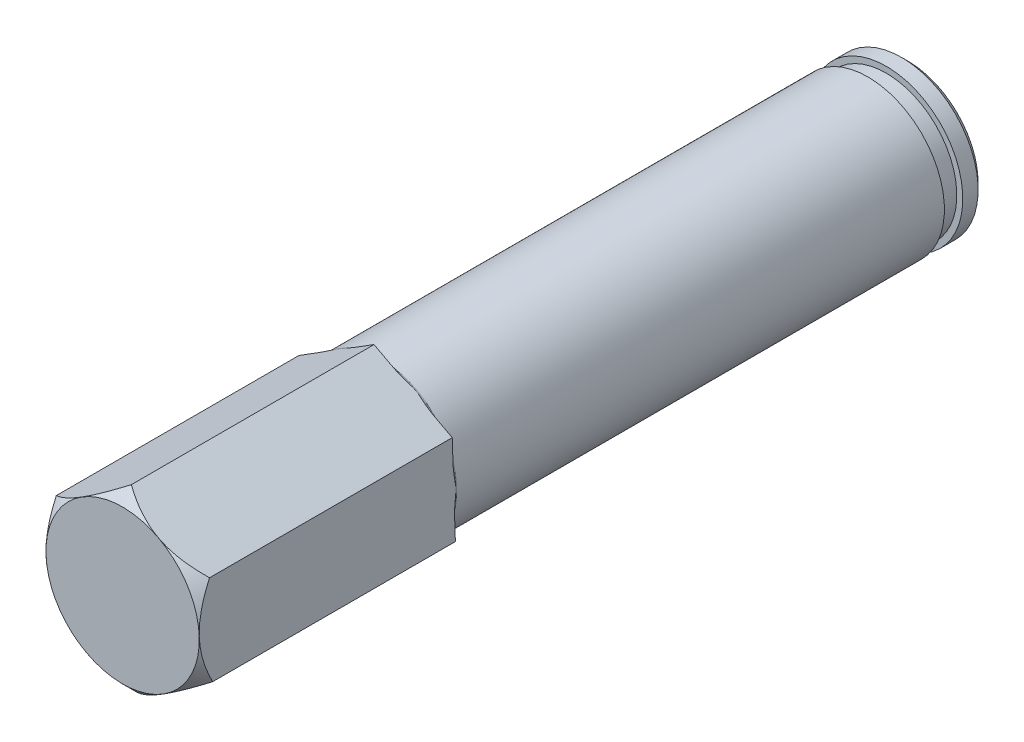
ISO-10303-21;
HEADER;
FILE_DESCRIPTION(('STEP AP214'),'2;1');
FILE_NAME('part.step','',(''),(''),'','','');
FILE_SCHEMA(('AUTOMOTIVE_DESIGN { 1 0 10303 214 1 1 1 1 }'));
ENDSEC;
DATA;
#1=APPLICATION_CONTEXT('core data for automotive mechanical design processes');
#2=APPLICATION_PROTOCOL_DEFINITION('international standard','automotive_design',2000,#1);
#3=PRODUCT_CONTEXT('',#1,'mechanical');
#4=PRODUCT('Part','Part','',(#3));
#5=PRODUCT_RELATED_PRODUCT_CATEGORY('part','',(#4));
#6=PRODUCT_DEFINITION_FORMATION('','',#4);
#7=PRODUCT_DEFINITION_CONTEXT('part definition',#1,'design');
#8=PRODUCT_DEFINITION('design','',#6,#7);
#9=PRODUCT_DEFINITION_SHAPE('','',#8);
#10=(LENGTH_UNIT() NAMED_UNIT(*) SI_UNIT(.MILLI.,.METRE.));
#11=(NAMED_UNIT(*) PLANE_ANGLE_UNIT() SI_UNIT($,.RADIAN.));
#12=(NAMED_UNIT(*) SI_UNIT($,.STERADIAN.) SOLID_ANGLE_UNIT());
#13=UNCERTAINTY_MEASURE_WITH_UNIT(LENGTH_MEASURE(1.E-05),#10,'distance_accuracy_value','');
#14=(GEOMETRIC_REPRESENTATION_CONTEXT(3) GLOBAL_UNCERTAINTY_ASSIGNED_CONTEXT((#13)) GLOBAL_UNIT_ASSIGNED_CONTEXT((#10,
#11,#12)) REPRESENTATION_CONTEXT('',''));
#15=CARTESIAN_POINT('',(0.,0.,0.));
#16=DIRECTION('',(0.,0.,1.));
#17=DIRECTION('',(1.,0.,0.));
#18=AXIS2_PLACEMENT_3D('',#15,#16,#17);
#19=CARTESIAN_POINT('',(3.10790353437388,1.94467708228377,-32.512));
#20=DIRECTION('',(0.468931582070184,0.883234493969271,0.));
#21=DIRECTION('',(-0.883234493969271,0.468931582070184,0.));
#22=AXIS2_PLACEMENT_3D('',#19,#20,#21);
#23=PLANE('',#22);
#24=DIRECTION('',(0.,0.,1.));
#25=VECTOR('',#24,1.);
#26=CARTESIAN_POINT('',(3.10790353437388,1.94467708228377,-32.512));
#27=LINE('',#26,#25);
#28=CARTESIAN_POINT('',(3.10790353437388,1.94467708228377,-10.541));
#29=VERTEX_POINT('',#28);
#30=CARTESIAN_POINT('',(3.10790353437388,1.94467708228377,-0.491174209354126));
#31=VERTEX_POINT('',#30);
#32=EDGE_CURVE('E314',#29,#31,#27,.T.);
#33=ORIENTED_EDGE('',*,*,#32,.F.);
#34=DIRECTION('',(-0.883234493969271,0.468931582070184,0.));
#35=VECTOR('',#34,1.);
#36=CARTESIAN_POINT('',(3.10790353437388,1.94467708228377,-10.541));
#37=LINE('',#36,#35);
#38=CARTESIAN_POINT('',(2.26925126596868,2.38993883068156,-10.541));
#39=VERTEX_POINT('',#38);
#40=EDGE_CURVE('E159',#29,#39,#37,.T.);
#41=ORIENTED_EDGE('',*,*,#40,.T.);
#42=CARTESIAN_POINT('',(2.61784669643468,2.2048606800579,-10.6682));
#43=CARTESIAN_POINT('',(2.61786534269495,2.20485078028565,-10.6652199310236));
#44=CARTESIAN_POINT('',(2.61762117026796,2.2049804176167,-10.6622498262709));
#45=CARTESIAN_POINT('',(2.61667621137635,2.20548212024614,-10.6564410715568));
#46=CARTESIAN_POINT('',(2.61598118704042,2.20585112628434,-10.6536012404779));
#47=CARTESIAN_POINT('',(2.61398819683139,2.20690925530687,-10.6474275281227));
#48=CARTESIAN_POINT('',(2.61258587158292,2.20765378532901,-10.6441376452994));
#49=CARTESIAN_POINT('',(2.60933076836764,2.20938200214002,-10.6378447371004));
#50=CARTESIAN_POINT('',(2.60747566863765,2.21036692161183,-10.6348433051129));
#51=CARTESIAN_POINT('',(2.60216274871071,2.21318768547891,-10.6273151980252));
#52=CARTESIAN_POINT('',(2.5984365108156,2.2151660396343,-10.6230341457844));
#53=CARTESIAN_POINT('',(2.59048680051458,2.21938674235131,-10.6151265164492));
#54=CARTESIAN_POINT('',(2.58626231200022,2.22162963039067,-10.6115013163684));
#55=CARTESIAN_POINT('',(2.57269654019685,2.22883204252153,-10.6010564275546));
#56=CARTESIAN_POINT('',(2.56283838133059,2.23406598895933,-10.5951092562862));
#57=CARTESIAN_POINT('',(2.54255014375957,2.24483752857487,-10.5846741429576));
#58=CARTESIAN_POINT('',(2.53211832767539,2.25037604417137,-10.5801909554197));
#59=CARTESIAN_POINT('',(2.50421487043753,2.26519069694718,-10.5697398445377));
#60=CARTESIAN_POINT('',(2.48649055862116,2.2746009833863,-10.5646444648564));
#61=CARTESIAN_POINT('',(2.45070170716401,2.29360219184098,-10.5562597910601));
#62=CARTESIAN_POINT('',(2.43263646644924,2.30319348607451,-10.5529747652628));
#63=CARTESIAN_POINT('',(2.3962880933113,2.3224917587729,-10.5477284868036));
#64=CARTESIAN_POINT('',(2.3780043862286,2.33219904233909,-10.5457724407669));
#65=CARTESIAN_POINT('',(2.34139829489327,2.35163414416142,-10.5429006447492));
#66=CARTESIAN_POINT('',(2.32307597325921,2.36136192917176,-10.5419837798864));
#67=CARTESIAN_POINT('',(2.2640544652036,2.39269794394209,-10.5403530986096));
#68=CARTESIAN_POINT('',(2.22332173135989,2.4143239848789,-10.5412511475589));
#69=CARTESIAN_POINT('',(2.14195228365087,2.45752508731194,-10.5456892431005));
#70=CARTESIAN_POINT('',(2.10131572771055,2.47910006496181,-10.5492322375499));
#71=CARTESIAN_POINT('',(2.02018449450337,2.5221746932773,-10.5581100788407));
#72=CARTESIAN_POINT('',(1.97968987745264,2.54367431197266,-10.5634456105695));
#73=CARTESIAN_POINT('',(1.89885753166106,2.58659025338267,-10.5752121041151));
#74=CARTESIAN_POINT('',(1.85851972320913,2.60800661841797,-10.5816424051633));
#75=CARTESIAN_POINT('',(1.79178675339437,2.64343684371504,-10.5925598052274));
#76=CARTESIAN_POINT('',(1.7653810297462,2.65745631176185,-10.59695222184));
#77=CARTESIAN_POINT('',(1.71253741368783,2.68551232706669,-10.605561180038));
#78=CARTESIAN_POINT('',(1.68609951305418,2.69954887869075,-10.609777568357));
#79=CARTESIAN_POINT('',(1.60696599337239,2.74156287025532,-10.6212631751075));
#80=CARTESIAN_POINT('',(1.55406240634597,2.7696507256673,-10.6274475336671));
#81=CARTESIAN_POINT('',(1.48149781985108,2.80817710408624,-10.6285501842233));
#82=CARTESIAN_POINT('',(1.46193396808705,2.8185640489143,-10.6281159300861));
#83=CARTESIAN_POINT('',(1.42285788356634,2.8393105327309,-10.6259686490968));
#84=CARTESIAN_POINT('',(1.40334569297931,2.84967004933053,-10.6242547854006));
#85=CARTESIAN_POINT('',(1.36434163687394,2.87037829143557,-10.6199928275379));
#86=CARTESIAN_POINT('',(1.34484998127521,2.88072690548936,-10.6174424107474));
#87=CARTESIAN_POINT('',(1.30592123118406,2.90139516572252,-10.6118965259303));
#88=CARTESIAN_POINT('',(1.28648412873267,2.9117148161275,-10.6089011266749));
#89=CARTESIAN_POINT('',(1.22781764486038,2.94286233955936,-10.5995830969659));
#90=CARTESIAN_POINT('',(1.18862359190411,2.9636714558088,-10.5929832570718));
#91=CARTESIAN_POINT('',(1.11022718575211,3.00529409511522,-10.5801989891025));
#92=CARTESIAN_POINT('',(1.07102489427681,3.02610758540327,-10.5740140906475));
#93=CARTESIAN_POINT('',(0.992877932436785,3.06759778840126,-10.5627646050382));
#94=CARTESIAN_POINT('',(0.953934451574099,3.08827386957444,-10.5576897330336));
#95=CARTESIAN_POINT('',(0.875908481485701,3.12969983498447,-10.549206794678));
#96=CARTESIAN_POINT('',(0.836826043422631,3.15044969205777,-10.5457981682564));
#97=CARTESIAN_POINT('',(0.778146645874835,3.1816040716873,-10.5425235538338));
#98=CARTESIAN_POINT('',(0.758590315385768,3.19198702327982,-10.5417383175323));
#99=CARTESIAN_POINT('',(0.719469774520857,3.21275711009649,-10.5409158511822));
#100=CARTESIAN_POINT('',(0.699905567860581,3.22314424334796,-10.5408784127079));
#101=CARTESIAN_POINT('',(0.660741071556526,3.24393766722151,-10.5417161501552));
#102=CARTESIAN_POINT('',(0.641140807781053,3.25434394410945,-10.5425935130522));
#103=CARTESIAN_POINT('',(0.601992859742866,3.27512858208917,-10.5455347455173));
#104=CARTESIAN_POINT('',(0.582445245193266,3.28550690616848,-10.547599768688));
#105=CARTESIAN_POINT('',(0.562963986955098,3.29584999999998,-10.5503934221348));
#106=B_SPLINE_CURVE_WITH_KNOTS('',3,(#42,#43,#44,#45,#46,#47,#48,#49,#50,#51,#52,#53,#54,#55,
#56,#57,#58,#59,#60,#61,#62,#63,#64,#65,#66,#67,#68,#69,#70,#71,#72,#73,#74,#75,#76,#77,#78,#79,
#80,#81,#82,#83,#84,#85,#86,#87,#88,#89,#90,#91,#92,#93,#94,#95,#96,#97,#98,#99,#100,#101,#102,
#103,#104,#105),.UNSPECIFIED.,.F.,.F.,(4,2,2,2,2,2,2,2,2,2,2,2,2,2,2,2,2,2,2,2,2,2,2,2,2,2,2,2,
2,2,2,4),(0.,0.00890829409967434,0.0177049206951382,0.0286025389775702,0.0395572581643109,
0.0574868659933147,0.0754536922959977,0.113183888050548,0.151035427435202,0.212991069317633,
0.275092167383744,0.337435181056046,0.399711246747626,0.537950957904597,0.676344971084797,
0.81479192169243,0.953155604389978,1.04379932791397,1.13452039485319,1.31461987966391,
1.38102785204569,1.44747929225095,1.51411681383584,1.58074404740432,1.71533472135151,
1.84977015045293,1.98290158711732,2.11598824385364,2.1824450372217,2.2488833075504,
2.31548077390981,2.38214303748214),.UNSPECIFIED.);
#107=CARTESIAN_POINT('',(0.708464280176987,3.21860020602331,-10.541));
#108=VERTEX_POINT('',#107);
#109=EDGE_CURVE('E229',#39,#108,#106,.T.);
#110=ORIENTED_EDGE('',*,*,#109,.T.);
#111=CARTESIAN_POINT('',(-0.130187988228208,3.6638619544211,-10.541));
#112=VERTEX_POINT('',#111);
#113=EDGE_CURVE('E169',#108,#112,#37,.T.);
#114=ORIENTED_EDGE('',*,*,#113,.T.);
#115=DIRECTION('',(0.,0.,1.));
#116=VECTOR('',#115,1.);
#117=CARTESIAN_POINT('',(-0.130187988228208,3.6638619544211,-32.512));
#118=LINE('',#117,#116);
#119=CARTESIAN_POINT('',(-0.130187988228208,3.6638619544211,-0.491174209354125));
#120=VERTEX_POINT('',#119);
#121=EDGE_CURVE('E331',#112,#120,#118,.T.);
#122=ORIENTED_EDGE('',*,*,#121,.T.);
#123=CARTESIAN_POINT('',(-0.130387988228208,3.66396813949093,-0.491287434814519));
#124=CARTESIAN_POINT('',(-0.0190811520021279,3.60487251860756,-0.428331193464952));
#125=CARTESIAN_POINT('',(0.0940868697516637,3.5447887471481,-0.369072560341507));
#126=CARTESIAN_POINT('',(0.324848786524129,3.42227139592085,-0.260571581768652));
#127=CARTESIAN_POINT('',(0.4424646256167,3.35982616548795,-0.211389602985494));
#128=CARTESIAN_POINT('',(0.679631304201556,3.23390836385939,-0.127140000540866));
#129=CARTESIAN_POINT('',(0.799121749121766,3.17046785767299,-0.0918606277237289));
#130=CARTESIAN_POINT('',(1.04073316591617,3.04219023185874,-0.0375055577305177));
#131=CARTESIAN_POINT('',(1.162846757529,2.97735703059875,-0.0183892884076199));
#132=CARTESIAN_POINT('',(1.37330493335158,2.86561945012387,-0.00114130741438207));
#133=CARTESIAN_POINT('',(1.46137773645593,2.81885936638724,0.001411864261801));
#134=CARTESIAN_POINT('',(1.63738008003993,2.72541526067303,-0.00289052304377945));
#135=CARTESIAN_POINT('',(1.72530955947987,2.67873127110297,-0.00974938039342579));
#136=CARTESIAN_POINT('',(1.90033548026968,2.58580557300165,-0.0324841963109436));
#137=CARTESIAN_POINT('',(1.98743087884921,2.53956441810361,-0.048370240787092));
#138=CARTESIAN_POINT('',(2.16012584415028,2.44787628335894,-0.0882923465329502));
#139=CARTESIAN_POINT('',(2.24572552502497,2.40242924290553,-0.112327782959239));
#140=CARTESIAN_POINT('',(2.39768931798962,2.32174781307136,-0.161779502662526));
#141=CARTESIAN_POINT('',(2.46438980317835,2.28633483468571,-0.185895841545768));
#142=CARTESIAN_POINT('',(2.59659331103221,2.2161446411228,-0.238015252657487));
#143=CARTESIAN_POINT('',(2.66209629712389,2.18136744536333,-0.2660184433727));
#144=CARTESIAN_POINT('',(2.79169844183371,2.11255838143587,-0.325283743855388));
#145=CARTESIAN_POINT('',(2.85580128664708,2.0785245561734,-0.356535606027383));
#146=CARTESIAN_POINT('',(2.98281979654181,2.01108720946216,-0.421887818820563));
#147=CARTESIAN_POINT('',(3.04573616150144,1.97768331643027,-0.455986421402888));
#148=CARTESIAN_POINT('',(3.10810353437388,1.94457089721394,-0.491287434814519));
#149=B_SPLINE_CURVE_WITH_KNOTS('',3,(#123,#124,#125,#126,#127,#128,#129,#130,#131,#132,#133,
#134,#135,#136,#137,#138,#139,#140,#141,#142,#143,#144,#145,#146,#147,#148),.UNSPECIFIED.,.F.,
.F.,(4,2,2,2,2,2,2,2,2,2,2,2,4),(0.,0.422909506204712,0.848282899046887,1.26690083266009,
1.68446481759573,1.98328847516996,2.28221687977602,2.58147993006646,2.88072003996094,
3.11843554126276,3.35615829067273,3.59315270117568,3.83000264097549),.UNSPECIFIED.);
#150=CARTESIAN_POINT('',(1.48885777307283,2.80426951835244,0.));
#151=VERTEX_POINT('',#150);
#152=EDGE_CURVE('E332',#120,#151,#149,.T.);
#153=ORIENTED_EDGE('',*,*,#152,.T.);
#154=EDGE_CURVE('E260',#151,#31,#149,.T.);
#155=ORIENTED_EDGE('',*,*,#154,.T.);
#156=EDGE_LOOP('',(#33,#41,#110,#114,#122,#153,#155));
#157=FACE_BOUND('',#156,.T.);
#158=ADVANCED_FACE('F33',(#157),#23,.T.);
#159=CARTESIAN_POINT('',(3.23809152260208,-1.71918487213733,-32.512));
#160=DIRECTION('',(0.999369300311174,0.0355105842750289,0.));
#161=DIRECTION('',(-0.0355105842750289,0.999369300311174,0.));
#162=AXIS2_PLACEMENT_3D('',#159,#160,#161);
#163=PLANE('',#162);
#164=DIRECTION('',(0.,0.,1.));
#165=VECTOR('',#164,1.);
#166=CARTESIAN_POINT('',(3.23809152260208,-1.71918487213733,-32.512));
#167=LINE('',#166,#165);
#168=CARTESIAN_POINT('',(3.23809152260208,-1.71918487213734,-10.541));
#169=VERTEX_POINT('',#168);
#170=CARTESIAN_POINT('',(3.23809152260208,-1.71918487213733,-0.491174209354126));
#171=VERTEX_POINT('',#170);
#172=EDGE_CURVE('E320',#169,#171,#167,.T.);
#173=ORIENTED_EDGE('',*,*,#172,.F.);
#174=DIRECTION('',(-0.0355105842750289,0.999369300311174,0.));
#175=VECTOR('',#174,1.);
#176=CARTESIAN_POINT('',(3.23809152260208,-1.71918487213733,-10.541));
#177=LINE('',#176,#175);
#178=CARTESIAN_POINT('',(3.20437337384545,-0.77025982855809,-10.541));
#179=VERTEX_POINT('',#178);
#180=EDGE_CURVE('E191',#169,#179,#177,.T.);
#181=ORIENTED_EDGE('',*,*,#180,.T.);
#182=CARTESIAN_POINT('',(3.21838870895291,-1.16469140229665,-10.6682));
#183=CARTESIAN_POINT('',(3.21838945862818,-1.16471250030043,-10.6652199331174));
#184=CARTESIAN_POINT('',(3.21837964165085,-1.1644362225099,-10.6622498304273));
#185=CARTESIAN_POINT('',(3.21834164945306,-1.16336701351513,-10.656441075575));
#186=CARTESIAN_POINT('',(3.21831370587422,-1.16258060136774,-10.6536012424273));
#187=CARTESIAN_POINT('',(3.21823357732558,-1.16032555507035,-10.6474275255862));
#188=CARTESIAN_POINT('',(3.21817719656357,-1.15873883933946,-10.6441376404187));
#189=CARTESIAN_POINT('',(3.21804632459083,-1.15505572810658,-10.637844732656));
#190=CARTESIAN_POINT('',(3.21797174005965,-1.15295670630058,-10.6348433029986));
#191=CARTESIAN_POINT('',(3.21775813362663,-1.14694521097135,-10.6273152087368));
#192=CARTESIAN_POINT('',(3.21760832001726,-1.1427290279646,-10.6230341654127));
#193=CARTESIAN_POINT('',(3.21728870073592,-1.13373402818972,-10.6151265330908));
#194=CARTESIAN_POINT('',(3.21711885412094,-1.12895405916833,-10.6115013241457));
#195=CARTESIAN_POINT('',(3.2165734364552,-1.11360444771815,-10.6010563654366));
#196=CARTESIAN_POINT('',(3.21617708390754,-1.10244995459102,-10.5951091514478));
#197=CARTESIAN_POINT('',(3.21536139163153,-1.07949404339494,-10.5846740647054));
#198=CARTESIAN_POINT('',(3.21494198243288,-1.067690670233,-10.5801909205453));
#199=CARTESIAN_POINT('',(3.21382014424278,-1.03611893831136,-10.5697400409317));
#200=CARTESIAN_POINT('',(3.21310755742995,-1.01606470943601,-10.5646447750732));
#201=CARTESIAN_POINT('',(3.21166870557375,-0.975571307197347,-10.5562602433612));
#202=CARTESIAN_POINT('',(3.21094241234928,-0.955131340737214,-10.5529752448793));
#203=CARTESIAN_POINT('',(3.20948102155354,-0.914003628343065,-10.5477288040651));
#204=CARTESIAN_POINT('',(3.20874590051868,-0.8933152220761,-10.5457726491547));
#205=CARTESIAN_POINT('',(3.20727410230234,-0.851894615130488,-10.5429007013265));
#206=CARTESIAN_POINT('',(3.20653742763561,-0.831162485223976,-10.5419837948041));
#207=CARTESIAN_POINT('',(3.20416441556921,-0.764379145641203,-10.5403530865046));
#208=CARTESIAN_POINT('',(3.20252672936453,-0.718289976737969,-10.5412511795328));
#209=CARTESIAN_POINT('',(3.19925522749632,-0.626220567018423,-10.5456893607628));
#210=CARTESIAN_POINT('',(3.1976214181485,-0.580240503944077,-10.549232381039));
#211=CARTESIAN_POINT('',(3.19435954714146,-0.488442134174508,-10.5581103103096));
#212=CARTESIAN_POINT('',(3.19273148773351,-0.442623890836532,-10.563445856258));
#213=CARTESIAN_POINT('',(3.18948164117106,-0.351163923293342,-10.575211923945));
#214=CARTESIAN_POINT('',(3.18785985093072,-0.305522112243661,-10.5816418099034));
#215=CARTESIAN_POINT('',(3.1851767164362,-0.230011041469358,-10.5925606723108));
#216=CARTESIAN_POINT('',(3.18411494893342,-0.200129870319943,-10.5969544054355));
#217=CARTESIAN_POINT('',(3.18199020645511,-0.140333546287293,-10.6055615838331));
#218=CARTESIAN_POINT('',(3.18092723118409,-0.110418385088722,-10.6097748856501));
#219=CARTESIAN_POINT('',(3.17774574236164,-0.0208821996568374,-10.6212728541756));
#220=CARTESIAN_POINT('',(3.17561881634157,0.0389755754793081,-10.6274951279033));
#221=CARTESIAN_POINT('',(3.17221721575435,0.134706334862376,-10.628704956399));
#222=CARTESIAN_POINT('',(3.17094532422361,0.170500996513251,-10.6272153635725));
#223=CARTESIAN_POINT('',(3.16840830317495,0.24190001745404,-10.6215399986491));
#224=CARTESIAN_POINT('',(3.1671431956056,0.277503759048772,-10.6173481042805));
#225=CARTESIAN_POINT('',(3.16460974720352,0.348802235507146,-10.6080326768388));
#226=CARTESIAN_POINT('',(3.16334143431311,0.38449618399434,-10.602903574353));
#227=CARTESIAN_POINT('',(3.16080648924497,0.455836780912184,-10.5925409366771));
#228=CARTESIAN_POINT('',(3.15953985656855,0.491483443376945,-10.5873074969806));
#229=CARTESIAN_POINT('',(3.15661859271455,0.573696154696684,-10.575665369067));
#230=CARTESIAN_POINT('',(3.15496330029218,0.620280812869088,-10.569384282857));
#231=CARTESIAN_POINT('',(3.15164988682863,0.713529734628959,-10.5581983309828));
#232=CARTESIAN_POINT('',(3.14999177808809,0.760193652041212,-10.5532907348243));
#233=CARTESIAN_POINT('',(3.14720891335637,0.838511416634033,-10.5468565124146));
#234=CARTESIAN_POINT('',(3.14608589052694,0.870116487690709,-10.5447494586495));
#235=CARTESIAN_POINT('',(3.14383707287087,0.9334046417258,-10.5418118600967));
#236=CARTESIAN_POINT('',(3.14271127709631,0.965087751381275,-10.5409818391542));
#237=CARTESIAN_POINT('',(3.140812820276,1.0185157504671,-10.5410129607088));
#238=CARTESIAN_POINT('',(3.14004019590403,1.04025960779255,-10.5414251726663));
#239=CARTESIAN_POINT('',(3.13849699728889,1.08368962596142,-10.5432490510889));
#240=CARTESIAN_POINT('',(3.13772642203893,1.10537581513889,-10.5446600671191));
#241=CARTESIAN_POINT('',(3.1358842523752,1.15721973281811,-10.5495443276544));
#242=CARTESIAN_POINT('',(3.13481421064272,1.18733376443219,-10.5536126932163));
#243=CARTESIAN_POINT('',(3.13318984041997,1.23304818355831,-10.5627981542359));
#244=CARTESIAN_POINT('',(3.13262604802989,1.24891491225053,-10.5665582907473));
#245=CARTESIAN_POINT('',(3.13151492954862,1.28018496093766,-10.5755913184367));
#246=CARTESIAN_POINT('',(3.1309675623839,1.29558943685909,-10.5808600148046));
#247=CARTESIAN_POINT('',(3.13002353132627,1.32215716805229,-10.5922574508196));
#248=CARTESIAN_POINT('',(3.12962046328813,1.3335006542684,-10.597932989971));
#249=CARTESIAN_POINT('',(3.12904887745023,1.34958671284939,-10.6080617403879));
#250=CARTESIAN_POINT('',(3.12886303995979,1.35481671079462,-10.6117287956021));
#251=CARTESIAN_POINT('',(3.12851115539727,1.36471974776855,-10.6197561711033));
#252=CARTESIAN_POINT('',(3.1283450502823,1.36939442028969,-10.6241143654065));
#253=CARTESIAN_POINT('',(3.12811629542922,1.37583223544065,-10.6314682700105));
#254=CARTESIAN_POINT('',(3.12804137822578,1.37794061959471,-10.6341592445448));
#255=CARTESIAN_POINT('',(3.12790521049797,1.38177276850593,-10.639806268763));
#256=CARTESIAN_POINT('',(3.12784394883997,1.38349684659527,-10.642762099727));
#257=CARTESIAN_POINT('',(3.12774750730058,1.386210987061,-10.6484661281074));
#258=CARTESIAN_POINT('',(3.12770980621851,1.38727200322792,-10.6511800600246));
#259=CARTESIAN_POINT('',(3.12765095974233,1.38892811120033,-10.6567438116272));
#260=CARTESIAN_POINT('',(3.12762977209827,1.38952439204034,-10.6595932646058));
#261=CARTESIAN_POINT('',(3.1276098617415,1.39008472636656,-10.6643725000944));
#262=CARTESIAN_POINT('',(3.12760595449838,1.39019468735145,-10.6662861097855));
#263=CARTESIAN_POINT('',(3.12760634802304,1.39018361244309,-10.6682));
#264=B_SPLINE_CURVE_WITH_KNOTS('',3,(#182,#183,#184,#185,#186,#187,#188,#189,#190,#191,#192,
#193,#194,#195,#196,#197,#198,#199,#200,#201,#202,#203,#204,#205,#206,#207,#208,#209,#210,#211,
#212,#213,#214,#215,#216,#217,#218,#219,#220,#221,#222,#223,#224,#225,#226,#227,#228,#229,#230,
#231,#232,#233,#234,#235,#236,#237,#238,#239,#240,#241,#242,#243,#244,#245,#246,#247,#248,#249,
#250,#251,#252,#253,#254,#255,#256,#257,#258,#259,#260,#261,#262,#263),.UNSPECIFIED.,.F.,.F.,(4,
2,2,2,2,2,2,2,2,2,2,2,2,2,2,2,2,2,2,2,2,2,2,2,2,2,2,2,2,2,2,2,2,2,2,2,2,2,2,2,4),(0.,
0.00890828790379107,0.0177049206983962,0.0286025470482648,0.0395572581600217,0.0574868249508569,
0.075453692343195,0.11318421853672,0.151035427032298,0.212989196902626,0.275088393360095,
0.337433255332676,0.399711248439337,0.537952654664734,0.676347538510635,0.814791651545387,
0.953155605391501,1.04380951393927,1.13453420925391,1.314619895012,1.42196255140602,
1.52954925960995,1.63779742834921,1.74595070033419,1.88704843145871,2.02786363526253,
2.12293069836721,2.21803674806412,2.28330047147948,2.34852173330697,2.43955325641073,
2.4884510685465,2.53721421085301,2.57511223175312,2.59424591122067,2.61332183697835,
2.62355631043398,2.63378240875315,2.64249120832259,2.65117765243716,2.65691528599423),.UNSPECIFIED.);
#265=CARTESIAN_POINT('',(3.14162168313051,0.995752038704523,-10.541));
#266=VERTEX_POINT('',#265);
#267=EDGE_CURVE('E223',#179,#266,#264,.T.);
#268=ORIENTED_EDGE('',*,*,#267,.T.);
#269=EDGE_CURVE('E193',#266,#29,#177,.T.);
#270=ORIENTED_EDGE('',*,*,#269,.T.);
#271=ORIENTED_EDGE('',*,*,#32,.T.);
#272=CARTESIAN_POINT('',(3.10789642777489,1.94487708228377,-0.491274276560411));
#273=CARTESIAN_POINT('',(3.11237148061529,1.81893630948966,-0.428319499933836));
#274=CARTESIAN_POINT('',(3.11692136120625,1.69088967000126,-0.369062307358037));
#275=CARTESIAN_POINT('',(3.12619905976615,1.42978872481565,-0.260564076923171));
#276=CARTESIAN_POINT('',(3.13092775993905,1.29670959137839,-0.211383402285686));
#277=CARTESIAN_POINT('',(3.14046295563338,1.02836194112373,-0.127136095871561));
#278=CARTESIAN_POINT('',(3.14526702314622,0.893161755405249,-0.0918577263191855));
#279=CARTESIAN_POINT('',(3.15498091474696,0.619785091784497,-0.0375042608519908));
#280=CARTESIAN_POINT('',(3.15989044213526,0.481616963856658,-0.0183885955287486));
#281=CARTESIAN_POINT('',(3.16835187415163,0.243488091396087,-0.00114111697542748));
#282=CARTESIAN_POINT('',(3.17189285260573,0.143834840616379,0.00141190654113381));
#283=CARTESIAN_POINT('',(3.17896904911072,-0.055309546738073,-0.00289076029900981));
#284=CARTESIAN_POINT('',(3.18250426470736,-0.154800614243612,-0.00974974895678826));
#285=CARTESIAN_POINT('',(3.18954120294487,-0.352840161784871,-0.0324848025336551));
#286=CARTESIAN_POINT('',(3.19304288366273,-0.45138746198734,-0.0483709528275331));
#287=CARTESIAN_POINT('',(3.19998610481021,-0.646789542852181,-0.0882932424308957));
#288=CARTESIAN_POINT('',(3.20342764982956,-0.743644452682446,-0.112328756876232));
#289=CARTESIAN_POINT('',(3.20953727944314,-0.9155868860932,-0.161779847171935));
#290=CARTESIAN_POINT('',(3.21221888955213,-0.991055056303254,-0.185895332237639));
#291=CARTESIAN_POINT('',(3.2175339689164,-1.14063657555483,-0.238012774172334));
#292=CARTESIAN_POINT('',(3.22016743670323,-1.21474988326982,-0.266014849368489));
#293=CARTESIAN_POINT('',(3.22537793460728,-1.3613881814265,-0.325277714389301));
#294=CARTESIAN_POINT('',(3.22795511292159,-1.43391734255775,-0.356528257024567));
#295=CARTESIAN_POINT('',(3.23306174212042,-1.57763247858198,-0.421877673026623));
#296=CARTESIAN_POINT('',(3.23559122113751,-1.6488192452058,-0.455974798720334));
#297=CARTESIAN_POINT('',(3.23809862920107,-1.71938487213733,-0.49127427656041));
#298=B_SPLINE_CURVE_WITH_KNOTS('',3,(#272,#273,#274,#275,#276,#277,#278,#279,#280,#281,#282,
#283,#284,#285,#286,#287,#288,#289,#290,#291,#292,#293,#294,#295,#296,#297),.UNSPECIFIED.,.F.,
.F.,(4,2,2,2,2,2,2,2,2,2,2,2,4),(0.,0.422903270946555,0.848270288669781,1.26688217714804,
1.68444017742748,1.98326359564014,2.28219175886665,2.58145455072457,2.88069440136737,
3.1184016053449,3.35611604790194,3.5931021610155,3.82994383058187),.UNSPECIFIED.);
#299=CARTESIAN_POINT('',(3.17299752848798,0.112746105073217,0.));
#300=VERTEX_POINT('',#299);
#301=EDGE_CURVE('E253',#31,#300,#298,.T.);
#302=ORIENTED_EDGE('',*,*,#301,.T.);
#303=EDGE_CURVE('E245',#300,#171,#298,.T.);
#304=ORIENTED_EDGE('',*,*,#303,.T.);
#305=EDGE_LOOP('',(#173,#181,#268,#270,#271,#302,#304));
#306=FACE_BOUND('',#305,.T.);
#307=ADVANCED_FACE('F234',(#306),#163,.T.);
#308=CARTESIAN_POINT('',(0.130187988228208,-3.6638619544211,-32.512));
#309=DIRECTION('',(0.530437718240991,-0.847723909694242,0.));
#310=DIRECTION('',(0.847723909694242,0.530437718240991,0.));
#311=AXIS2_PLACEMENT_3D('',#308,#309,#310);
#312=PLANE('',#311);
#313=DIRECTION('',(0.,0.,1.));
#314=VECTOR('',#313,1.);
#315=CARTESIAN_POINT('',(0.130187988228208,-3.6638619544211,-32.512));
#316=LINE('',#315,#314);
#317=CARTESIAN_POINT('',(0.130187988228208,-3.6638619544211,-10.541));
#318=VERTEX_POINT('',#317);
#319=CARTESIAN_POINT('',(0.130187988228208,-3.6638619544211,-0.491174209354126));
#320=VERTEX_POINT('',#319);
#321=EDGE_CURVE('E324',#318,#320,#316,.T.);
#322=ORIENTED_EDGE('',*,*,#321,.F.);
#323=DIRECTION('',(0.847723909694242,0.530437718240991,0.));
#324=VECTOR('',#323,1.);
#325=CARTESIAN_POINT('',(0.130187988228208,-3.6638619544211,-10.541));
#326=LINE('',#325,#324);
#327=CARTESIAN_POINT('',(0.935122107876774,-3.16019865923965,-10.541));
#328=VERTEX_POINT('',#327);
#329=EDGE_CURVE('E186',#318,#328,#326,.T.);
#330=ORIENTED_EDGE('',*,*,#329,.T.);
#331=CARTESIAN_POINT('',(0.718329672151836,-3.295849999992,-10.5674434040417));
#332=CARTESIAN_POINT('',(0.727194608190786,-3.29030303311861,-10.5647251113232));
#333=CARTESIAN_POINT('',(0.73612003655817,-3.28471821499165,-10.5623045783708));
#334=CARTESIAN_POINT('',(0.754053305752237,-3.2734970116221,-10.5579705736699));
#335=CARTESIAN_POINT('',(0.763061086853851,-3.26786066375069,-10.556056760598));
#336=CARTESIAN_POINT('',(0.790126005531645,-3.25092560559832,-10.5509460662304));
#337=CARTESIAN_POINT('',(0.808266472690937,-3.23957475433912,-10.5483680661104));
#338=CARTESIAN_POINT('',(0.844484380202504,-3.21691248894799,-10.5444591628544));
#339=CARTESIAN_POINT('',(0.862561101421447,-3.20560152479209,-10.5431181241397));
#340=CARTESIAN_POINT('',(0.898758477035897,-3.18295210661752,-10.5413896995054));
#341=CARTESIAN_POINT('',(0.916879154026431,-3.17161363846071,-10.5410030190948));
#342=CARTESIAN_POINT('',(0.970940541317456,-3.13778635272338,-10.5409940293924));
#343=CARTESIAN_POINT('',(1.00688017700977,-3.11529820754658,-10.5424974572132));
#344=CARTESIAN_POINT('',(1.07864583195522,-3.07039300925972,-10.547567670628));
#345=CARTESIAN_POINT('',(1.11447183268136,-3.04797596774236,-10.5511347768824));
#346=CARTESIAN_POINT('',(1.22224690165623,-2.98053896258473,-10.5640634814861));
#347=CARTESIAN_POINT('',(1.29399314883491,-2.93564590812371,-10.5756331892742));
#348=CARTESIAN_POINT('',(1.39092374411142,-2.87499450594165,-10.592134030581));
#349=CARTESIAN_POINT('',(1.41618945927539,-2.8591852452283,-10.5965152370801));
#350=CARTESIAN_POINT('',(1.46674244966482,-2.8275532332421,-10.6051059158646));
#351=CARTESIAN_POINT('',(1.49202972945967,-2.81173047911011,-10.6093153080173));
#352=CARTESIAN_POINT('',(1.56764401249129,-2.76441711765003,-10.6208606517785));
#353=CARTESIAN_POINT('',(1.61816076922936,-2.73280777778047,-10.6272047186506));
#354=CARTESIAN_POINT('',(1.69923809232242,-2.68207608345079,-10.6287785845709));
#355=CARTESIAN_POINT('',(1.72972084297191,-2.66300241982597,-10.627432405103));
#356=CARTESIAN_POINT('',(1.79052424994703,-2.62495651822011,-10.6219374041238));
#357=CARTESIAN_POINT('',(1.8208443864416,-2.60598460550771,-10.61778227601));
#358=CARTESIAN_POINT('',(1.88156238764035,-2.56799214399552,-10.6084969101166));
#359=CARTESIAN_POINT('',(1.91195952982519,-2.54897204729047,-10.6033606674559));
#360=CARTESIAN_POINT('',(1.97271228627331,-2.51095783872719,-10.5929656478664));
#361=CARTESIAN_POINT('',(2.00306791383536,-2.49196371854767,-10.5877069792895));
#362=CARTESIAN_POINT('',(2.07304606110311,-2.44817699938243,-10.5760046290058));
#363=CARTESIAN_POINT('',(2.11268404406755,-2.42337472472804,-10.569685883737));
#364=CARTESIAN_POINT('',(2.19202454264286,-2.37372979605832,-10.5584224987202));
#365=CARTESIAN_POINT('',(2.23172675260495,-2.34888733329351,-10.5534750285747));
#366=CARTESIAN_POINT('',(2.29836717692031,-2.30718909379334,-10.5469751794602));
#367=CARTESIAN_POINT('',(2.32526369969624,-2.29035940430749,-10.5448420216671));
#368=CARTESIAN_POINT('',(2.37910654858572,-2.25666886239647,-10.5418561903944));
#369=CARTESIAN_POINT('',(2.40605286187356,-2.23980801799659,-10.5410032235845));
#370=CARTESIAN_POINT('',(2.45149742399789,-2.21137245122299,-10.5409978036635));
#371=CARTESIAN_POINT('',(2.46999453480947,-2.1997984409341,-10.5413958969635));
#372=CARTESIAN_POINT('',(2.50694023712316,-2.17668077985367,-10.5431936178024));
#373=CARTESIAN_POINT('',(2.52538885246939,-2.1651371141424,-10.544592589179));
#374=CARTESIAN_POINT('',(2.56949067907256,-2.13754172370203,-10.5494509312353));
#375=CARTESIAN_POINT('',(2.59510713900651,-2.12151299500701,-10.5535064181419));
#376=CARTESIAN_POINT('',(2.6339853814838,-2.09718610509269,-10.5626753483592));
#377=CARTESIAN_POINT('',(2.64747269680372,-2.08874682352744,-10.5664281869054));
#378=CARTESIAN_POINT('',(2.67405544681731,-2.07211346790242,-10.575446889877));
#379=CARTESIAN_POINT('',(2.68715185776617,-2.06391878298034,-10.5807085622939));
#380=CARTESIAN_POINT('',(2.70975160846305,-2.0497776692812,-10.5920972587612));
#381=CARTESIAN_POINT('',(2.71940684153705,-2.04373619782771,-10.597772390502));
#382=CARTESIAN_POINT('',(2.73310360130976,-2.03516586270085,-10.6079037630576));
#383=CARTESIAN_POINT('',(2.73755784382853,-2.03237875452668,-10.6115724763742));
#384=CARTESIAN_POINT('',(2.74599323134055,-2.02710056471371,-10.6196037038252));
#385=CARTESIAN_POINT('',(2.74997588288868,-2.02460854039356,-10.6239638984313));
#386=CARTESIAN_POINT('',(2.75546123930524,-2.02117624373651,-10.6313196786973));
#387=CARTESIAN_POINT('',(2.75725686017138,-2.02005268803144,-10.6340089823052));
#388=CARTESIAN_POINT('',(2.76052472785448,-2.01800791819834,-10.6396557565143));
#389=CARTESIAN_POINT('',(2.76199685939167,-2.01708677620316,-10.6426133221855));
#390=CARTESIAN_POINT('',(2.76452217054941,-2.01550663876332,-10.6488285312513));
#391=CARTESIAN_POINT('',(2.76556875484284,-2.01485177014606,-10.6520900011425));
#392=CARTESIAN_POINT('',(2.7670789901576,-2.01390678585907,-10.658790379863));
#393=CARTESIAN_POINT('',(2.76754521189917,-2.01361506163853,-10.6622284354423));
#394=CARTESIAN_POINT('',(2.76772487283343,-2.01350264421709,-10.666518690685));
#395=CARTESIAN_POINT('',(2.76774097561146,-2.01349256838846,-10.6673595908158));
#396=CARTESIAN_POINT('',(2.76773749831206,-2.01349474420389,-10.6682));
#397=B_SPLINE_CURVE_WITH_KNOTS('',3,(#331,#332,#333,#334,#335,#336,#337,#338,#339,#340,#341,
#342,#343,#344,#345,#346,#347,#348,#349,#350,#351,#352,#353,#354,#355,#356,#357,#358,#359,#360,
#361,#362,#363,#364,#365,#366,#367,#368,#369,#370,#371,#372,#373,#374,#375,#376,#377,#378,#379,
#380,#381,#382,#383,#384,#385,#386,#387,#388,#389,#390,#391,#392,#393,#394,#395,#396),
.UNSPECIFIED.,.F.,.F.,(4,2,2,2,2,2,2,2,2,2,2,2,2,2,2,2,2,2,2,2,2,2,2,2,2,2,2,2,2,2,2,2,4),(0.,
0.0324014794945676,0.0647810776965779,0.129388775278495,0.193462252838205,0.257583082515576,
0.384764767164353,0.511966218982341,0.768134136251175,0.858502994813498,0.948913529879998,
1.12815903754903,1.23590304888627,1.3438897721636,1.4525599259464,1.5611373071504,
1.70267874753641,1.84392582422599,1.93930614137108,2.03466460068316,2.10011394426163,
2.16552041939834,2.25679897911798,2.30578901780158,2.35464424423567,2.39264647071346,
2.41183475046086,2.43095997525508,2.44120590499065,2.45145548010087,2.46185835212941,
2.47221497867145,2.47473710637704),.UNSPECIFIED.);
#398=CARTESIAN_POINT('',(2.43315740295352,-2.22284816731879,-10.541));
#399=VERTEX_POINT('',#398);
#400=EDGE_CURVE('E217',#328,#399,#397,.T.);
#401=ORIENTED_EDGE('',*,*,#400,.T.);
#402=EDGE_CURVE('E190',#399,#169,#326,.T.);
#403=ORIENTED_EDGE('',*,*,#402,.T.);
#404=ORIENTED_EDGE('',*,*,#172,.T.);
#405=CARTESIAN_POINT('',(3.23829152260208,-1.71905972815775,-0.491292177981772));
#406=CARTESIAN_POINT('',(3.13145931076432,-1.78590676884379,-0.428335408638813));
#407=CARTESIAN_POINT('',(3.02284072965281,-1.85387157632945,-0.369076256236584));
#408=CARTESIAN_POINT('',(2.80135558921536,-1.9924592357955,-0.260574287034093));
#409=CARTESIAN_POINT('',(2.68846796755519,-2.0630952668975,-0.211391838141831));
#410=CARTESIAN_POINT('',(2.46083550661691,-2.20552942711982,-0.127141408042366));
#411=CARTESIAN_POINT('',(2.34614863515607,-2.27729128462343,-0.0918616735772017));
#412=CARTESIAN_POINT('',(2.11425009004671,-2.42239481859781,-0.0375060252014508));
#413=CARTESIAN_POINT('',(1.99704550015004,-2.4957320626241,-0.0183895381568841));
#414=CARTESIAN_POINT('',(1.79504820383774,-2.62212579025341,-0.00114137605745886));
#415=CARTESIAN_POINT('',(1.71051635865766,-2.67501904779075,0.00141184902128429));
#416=CARTESIAN_POINT('',(1.54159016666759,-2.78071952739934,-0.00289043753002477));
#417=CARTESIAN_POINT('',(1.45719587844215,-2.83352671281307,-0.0097492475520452));
#418=CARTESIAN_POINT('',(1.28920684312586,-2.9386407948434,-0.0324839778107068));
#419=CARTESIAN_POINT('',(1.20561309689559,-2.99094706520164,-0.0483699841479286));
#420=CARTESIAN_POINT('',(1.03986129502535,-3.09466126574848,-0.088292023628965));
#421=CARTESIAN_POINT('',(0.957703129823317,-3.14606926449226,-0.112327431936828));
#422=CARTESIAN_POINT('',(0.811848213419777,-3.23733358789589,-0.161779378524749));
#423=CARTESIAN_POINT('',(0.747828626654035,-3.27739191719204,-0.185896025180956));
#424=CARTESIAN_POINT('',(0.620938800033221,-3.35678940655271,-0.238016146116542));
#425=CARTESIAN_POINT('',(0.558068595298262,-3.39612854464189,-0.266019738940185));
#426=CARTESIAN_POINT('',(0.433675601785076,-3.47396371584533,-0.325285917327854));
#427=CARTESIAN_POINT('',(0.372149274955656,-3.51246196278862,-0.356538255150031));
#428=CARTESIAN_POINT('',(0.250236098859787,-3.58874546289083,-0.421891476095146));
#429=CARTESIAN_POINT('',(0.18984857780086,-3.62653113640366,-0.455990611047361));
#430=CARTESIAN_POINT('',(0.129987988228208,-3.66398709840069,-0.491292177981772));
#431=B_SPLINE_CURVE_WITH_KNOTS('',3,(#405,#406,#407,#408,#409,#410,#411,#412,#413,#414,#415,
#416,#417,#418,#419,#420,#421,#422,#423,#424,#425,#426,#427,#428,#429,#430),.UNSPECIFIED.,.F.,
.F.,(4,2,2,2,2,2,2,2,2,2,2,2,4),(0.,0.422911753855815,0.848287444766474,1.26690755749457,
1.68447369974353,1.98329744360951,2.28222593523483,2.5814890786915,2.88072928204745,
3.11844777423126,3.35617351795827,3.59317091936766,3.8300238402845),.UNSPECIFIED.);
#432=CARTESIAN_POINT('',(1.68413975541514,-2.69152341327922,0.));
#433=VERTEX_POINT('',#432);
#434=EDGE_CURVE('E254',#171,#433,#431,.T.);
#435=ORIENTED_EDGE('',*,*,#434,.T.);
#436=EDGE_CURVE('E255',#433,#320,#431,.T.);
#437=ORIENTED_EDGE('',*,*,#436,.T.);
#438=EDGE_LOOP('',(#322,#330,#401,#403,#404,#435,#437));
#439=FACE_BOUND('',#438,.T.);
#440=ADVANCED_FACE('F238',(#439),#312,.T.);
#441=CARTESIAN_POINT('',(-3.10790353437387,-1.94467708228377,-32.512));
#442=DIRECTION('',(-0.468931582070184,-0.883234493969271,0.));
#443=DIRECTION('',(0.883234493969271,-0.468931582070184,0.));
#444=AXIS2_PLACEMENT_3D('',#441,#442,#443);
#445=PLANE('',#444);
#446=DIRECTION('',(0.,0.,1.));
#447=VECTOR('',#446,1.);
#448=CARTESIAN_POINT('',(-3.10790353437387,-1.94467708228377,-32.512));
#449=LINE('',#448,#447);
#450=CARTESIAN_POINT('',(-3.10790353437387,-1.94467708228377,-10.541));
#451=VERTEX_POINT('',#450);
#452=CARTESIAN_POINT('',(-3.10790353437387,-1.94467708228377,-0.491174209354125));
#453=VERTEX_POINT('',#452);
#454=EDGE_CURVE('E328',#451,#453,#449,.T.);
#455=ORIENTED_EDGE('',*,*,#454,.F.);
#456=DIRECTION('',(0.883234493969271,-0.468931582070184,0.));
#457=VECTOR('',#456,1.);
#458=CARTESIAN_POINT('',(-3.10790353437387,-1.94467708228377,-10.541));
#459=LINE('',#458,#457);
#460=CARTESIAN_POINT('',(-2.26925126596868,-2.38993883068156,-10.541));
#461=VERTEX_POINT('',#460);
#462=EDGE_CURVE('E178',#451,#461,#459,.T.);
#463=ORIENTED_EDGE('',*,*,#462,.T.);
#464=CARTESIAN_POINT('',(-2.61784669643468,-2.2048606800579,-10.6682));
#465=CARTESIAN_POINT('',(-2.61786534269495,-2.20485078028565,-10.6652199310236));
#466=CARTESIAN_POINT('',(-2.61762117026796,-2.2049804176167,-10.6622498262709));
#467=CARTESIAN_POINT('',(-2.61667621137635,-2.20548212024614,-10.6564410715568));
#468=CARTESIAN_POINT('',(-2.61598118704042,-2.20585112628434,-10.6536012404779));
#469=CARTESIAN_POINT('',(-2.61398819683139,-2.20690925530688,-10.6474275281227));
#470=CARTESIAN_POINT('',(-2.61258587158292,-2.20765378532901,-10.6441376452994));
#471=CARTESIAN_POINT('',(-2.60933076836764,-2.20938200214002,-10.6378447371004));
#472=CARTESIAN_POINT('',(-2.60747566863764,-2.21036692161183,-10.6348433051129));
#473=CARTESIAN_POINT('',(-2.60216274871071,-2.21318768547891,-10.6273151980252));
#474=CARTESIAN_POINT('',(-2.5984365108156,-2.2151660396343,-10.6230341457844));
#475=CARTESIAN_POINT('',(-2.59048680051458,-2.21938674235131,-10.6151265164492));
#476=CARTESIAN_POINT('',(-2.58626231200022,-2.22162963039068,-10.6115013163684));
#477=CARTESIAN_POINT('',(-2.57269654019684,-2.22883204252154,-10.6010564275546));
#478=CARTESIAN_POINT('',(-2.56283838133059,-2.23406598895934,-10.5951092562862));
#479=CARTESIAN_POINT('',(-2.54255014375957,-2.24483752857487,-10.5846741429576));
#480=CARTESIAN_POINT('',(-2.53211832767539,-2.25037604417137,-10.5801909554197));
#481=CARTESIAN_POINT('',(-2.50421487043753,-2.26519069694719,-10.5697398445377));
#482=CARTESIAN_POINT('',(-2.48649055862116,-2.2746009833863,-10.5646444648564));
#483=CARTESIAN_POINT('',(-2.450701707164,-2.29360219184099,-10.5562597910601));
#484=CARTESIAN_POINT('',(-2.43263646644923,-2.30319348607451,-10.5529747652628));
#485=CARTESIAN_POINT('',(-2.39628809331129,-2.32249175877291,-10.5477284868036));
#486=CARTESIAN_POINT('',(-2.37800438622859,-2.3321990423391,-10.5457724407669));
#487=CARTESIAN_POINT('',(-2.34139829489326,-2.35163414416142,-10.5429006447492));
#488=CARTESIAN_POINT('',(-2.3230759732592,-2.36136192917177,-10.5419837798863));
#489=CARTESIAN_POINT('',(-2.26405446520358,-2.3926979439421,-10.5403530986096));
#490=CARTESIAN_POINT('',(-2.22332173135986,-2.41432398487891,-10.5412511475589));
#491=CARTESIAN_POINT('',(-2.14195228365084,-2.45752508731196,-10.5456892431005));
#492=CARTESIAN_POINT('',(-2.10131572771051,-2.47910006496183,-10.5492322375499));
#493=CARTESIAN_POINT('',(-2.02018449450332,-2.52217469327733,-10.5581100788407));
#494=CARTESIAN_POINT('',(-1.97968987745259,-2.54367431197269,-10.5634456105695));
#495=CARTESIAN_POINT('',(-1.898857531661,-2.58659025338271,-10.5752121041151));
#496=CARTESIAN_POINT('',(-1.85851972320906,-2.608006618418,-10.5816424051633));
#497=CARTESIAN_POINT('',(-1.79178675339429,-2.64343684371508,-10.5925598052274));
#498=CARTESIAN_POINT('',(-1.76538102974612,-2.65745631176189,-10.59695222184));
#499=CARTESIAN_POINT('',(-1.71253741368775,-2.68551232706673,-10.6055611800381));
#500=CARTESIAN_POINT('',(-1.68609951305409,-2.69954887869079,-10.609777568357));
#501=CARTESIAN_POINT('',(-1.60696599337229,-2.74156287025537,-10.6212631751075));
#502=CARTESIAN_POINT('',(-1.55406240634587,-2.76965072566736,-10.6274475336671));
#503=CARTESIAN_POINT('',(-1.48149781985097,-2.8081771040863,-10.6285501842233));
#504=CARTESIAN_POINT('',(-1.46193396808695,-2.81856404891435,-10.6281159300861));
#505=CARTESIAN_POINT('',(-1.42285788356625,-2.83931053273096,-10.6259686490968));
#506=CARTESIAN_POINT('',(-1.40334569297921,-2.84967004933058,-10.6242547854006));
#507=CARTESIAN_POINT('',(-1.36434163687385,-2.87037829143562,-10.6199928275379));
#508=CARTESIAN_POINT('',(-1.34484998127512,-2.88072690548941,-10.6174424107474));
#509=CARTESIAN_POINT('',(-1.30592123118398,-2.90139516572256,-10.6118965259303));
#510=CARTESIAN_POINT('',(-1.28648412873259,-2.91171481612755,-10.6089011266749));
#511=CARTESIAN_POINT('',(-1.2278176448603,-2.9428623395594,-10.5995830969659));
#512=CARTESIAN_POINT('',(-1.18862359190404,-2.96367145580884,-10.5929832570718));
#513=CARTESIAN_POINT('',(-1.11022718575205,-3.00529409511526,-10.5801989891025));
#514=CARTESIAN_POINT('',(-1.07102489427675,-3.0261075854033,-10.5740140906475));
#515=CARTESIAN_POINT('',(-0.992877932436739,-3.06759778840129,-10.5627646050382));
#516=CARTESIAN_POINT('',(-0.953934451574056,-3.08827386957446,-10.5576897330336));
#517=CARTESIAN_POINT('',(-0.875908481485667,-3.12969983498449,-10.549206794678));
#518=CARTESIAN_POINT('',(-0.836826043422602,-3.15044969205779,-10.5457981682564));
#519=CARTESIAN_POINT('',(-0.778146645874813,-3.18160407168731,-10.5425235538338));
#520=CARTESIAN_POINT('',(-0.758590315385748,-3.19198702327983,-10.5417383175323));
#521=CARTESIAN_POINT('',(-0.719469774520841,-3.2127571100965,-10.5409158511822));
#522=CARTESIAN_POINT('',(-0.699905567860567,-3.22314424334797,-10.5408784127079));
#523=CARTESIAN_POINT('',(-0.660741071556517,-3.24393766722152,-10.5417161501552));
#524=CARTESIAN_POINT('',(-0.641140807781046,-3.25434394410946,-10.5425935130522));
#525=CARTESIAN_POINT('',(-0.601992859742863,-3.27512858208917,-10.5455347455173));
#526=CARTESIAN_POINT('',(-0.582445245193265,-3.28550690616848,-10.547599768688));
#527=CARTESIAN_POINT('',(-0.562963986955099,-3.29584999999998,-10.5503934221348));
#528=B_SPLINE_CURVE_WITH_KNOTS('',3,(#464,#465,#466,#467,#468,#469,#470,#471,#472,#473,#474,
#475,#476,#477,#478,#479,#480,#481,#482,#483,#484,#485,#486,#487,#488,#489,#490,#491,#492,#493,
#494,#495,#496,#497,#498,#499,#500,#501,#502,#503,#504,#505,#506,#507,#508,#509,#510,#511,#512,
#513,#514,#515,#516,#517,#518,#519,#520,#521,#522,#523,#524,#525,#526,#527),.UNSPECIFIED.,.F.,
.F.,(4,2,2,2,2,2,2,2,2,2,2,2,2,2,2,2,2,2,2,2,2,2,2,2,2,2,2,2,2,2,2,4),(0.,0.0089082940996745,
0.0177049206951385,0.0286025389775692,0.0395572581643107,0.057486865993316,0.0754536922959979,
0.113183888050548,0.151035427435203,0.212991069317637,0.275092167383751,0.337435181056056,
0.399711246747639,0.537950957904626,0.676344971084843,0.814791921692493,0.953155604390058,
1.04379932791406,1.13452039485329,1.31461987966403,1.3810278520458,1.44747929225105,
1.51411681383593,1.58074404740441,1.71533472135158,1.84977015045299,1.98290158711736,
2.11598824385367,2.18244503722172,2.24888330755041,2.31548077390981,2.38214303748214),.UNSPECIFIED.);
#529=CARTESIAN_POINT('',(-0.708464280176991,-3.21860020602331,-10.541));
#530=VERTEX_POINT('',#529);
#531=EDGE_CURVE('E158',#461,#530,#528,.T.);
#532=ORIENTED_EDGE('',*,*,#531,.T.);
#533=EDGE_CURVE('E181',#530,#318,#459,.T.);
#534=ORIENTED_EDGE('',*,*,#533,.T.);
#535=ORIENTED_EDGE('',*,*,#321,.T.);
#536=CARTESIAN_POINT('',(0.130387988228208,-3.66396813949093,-0.491287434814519));
#537=CARTESIAN_POINT('',(0.0190811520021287,-3.60487251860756,-0.428331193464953));
#538=CARTESIAN_POINT('',(-0.0940868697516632,-3.5447887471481,-0.369072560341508));
#539=CARTESIAN_POINT('',(-0.324848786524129,-3.42227139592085,-0.260571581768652));
#540=CARTESIAN_POINT('',(-0.442464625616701,-3.35982616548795,-0.211389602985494));
#541=CARTESIAN_POINT('',(-0.679631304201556,-3.23390836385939,-0.127140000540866));
#542=CARTESIAN_POINT('',(-0.799121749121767,-3.17046785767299,-0.091860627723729));
#543=CARTESIAN_POINT('',(-1.04073316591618,-3.04219023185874,-0.0375055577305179));
#544=CARTESIAN_POINT('',(-1.16284675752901,-2.97735703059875,-0.0183892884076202));
#545=CARTESIAN_POINT('',(-1.37330493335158,-2.86561945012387,-0.00114130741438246));
#546=CARTESIAN_POINT('',(-1.46137773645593,-2.81885936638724,0.00141186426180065));
#547=CARTESIAN_POINT('',(-1.63738008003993,-2.72541526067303,-0.00289052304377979));
#548=CARTESIAN_POINT('',(-1.72530955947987,-2.67873127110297,-0.00974938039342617));
#549=CARTESIAN_POINT('',(-1.90033548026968,-2.58580557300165,-0.0324841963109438));
#550=CARTESIAN_POINT('',(-1.98743087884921,-2.53956441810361,-0.048370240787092));
#551=CARTESIAN_POINT('',(-2.16012584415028,-2.44787628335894,-0.0882923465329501));
#552=CARTESIAN_POINT('',(-2.24572552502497,-2.40242924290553,-0.112327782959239));
#553=CARTESIAN_POINT('',(-2.39768931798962,-2.32174781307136,-0.161779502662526));
#554=CARTESIAN_POINT('',(-2.46438980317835,-2.28633483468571,-0.185895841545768));
#555=CARTESIAN_POINT('',(-2.59659331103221,-2.2161446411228,-0.238015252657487));
#556=CARTESIAN_POINT('',(-2.66209629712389,-2.18136744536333,-0.2660184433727));
#557=CARTESIAN_POINT('',(-2.79169844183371,-2.11255838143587,-0.325283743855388));
#558=CARTESIAN_POINT('',(-2.85580128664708,-2.0785245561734,-0.356535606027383));
#559=CARTESIAN_POINT('',(-2.98281979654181,-2.01108720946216,-0.421887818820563));
#560=CARTESIAN_POINT('',(-3.04573616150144,-1.97768331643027,-0.455986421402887));
#561=CARTESIAN_POINT('',(-3.10810353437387,-1.94457089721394,-0.491287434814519));
#562=B_SPLINE_CURVE_WITH_KNOTS('',3,(#536,#537,#538,#539,#540,#541,#542,#543,#544,#545,#546,
#547,#548,#549,#550,#551,#552,#553,#554,#555,#556,#557,#558,#559,#560,#561),.UNSPECIFIED.,.F.,
.F.,(4,2,2,2,2,2,2,2,2,2,2,2,4),(0.,0.422909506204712,0.848282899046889,1.26690083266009,
1.68446481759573,1.98328847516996,2.28221687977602,2.58147993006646,2.88072003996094,
3.11843554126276,3.35615829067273,3.59315270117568,3.83000264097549),.UNSPECIFIED.);
#563=CARTESIAN_POINT('',(-1.48885777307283,-2.80426951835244,0.));
#564=VERTEX_POINT('',#563);
#565=EDGE_CURVE('E295',#320,#564,#562,.T.);
#566=ORIENTED_EDGE('',*,*,#565,.T.);
#567=EDGE_CURVE('E290',#564,#453,#562,.T.);
#568=ORIENTED_EDGE('',*,*,#567,.T.);
#569=EDGE_LOOP('',(#455,#463,#532,#534,#535,#566,#568));
#570=FACE_BOUND('',#569,.T.);
#571=ADVANCED_FACE('F297',(#570),#445,.T.);
#572=CARTESIAN_POINT('',(-3.23809152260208,1.71918487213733,-32.512));
#573=DIRECTION('',(-0.999369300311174,-0.0355105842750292,0.));
#574=DIRECTION('',(0.0355105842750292,-0.999369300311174,0.));
#575=AXIS2_PLACEMENT_3D('',#572,#573,#574);
#576=PLANE('',#575);
#577=DIRECTION('',(0.,0.,1.));
#578=VECTOR('',#577,1.);
#579=CARTESIAN_POINT('',(-3.23809152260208,1.71918487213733,-32.512));
#580=LINE('',#579,#578);
#581=CARTESIAN_POINT('',(-3.23809152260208,1.71918487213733,-10.541));
#582=VERTEX_POINT('',#581);
#583=CARTESIAN_POINT('',(-3.23809152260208,1.71918487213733,-0.491174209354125));
#584=VERTEX_POINT('',#583);
#585=EDGE_CURVE('E168',#582,#584,#580,.T.);
#586=ORIENTED_EDGE('',*,*,#585,.F.);
#587=DIRECTION('',(0.0355105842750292,-0.999369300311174,0.));
#588=VECTOR('',#587,1.);
#589=CARTESIAN_POINT('',(-3.23809152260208,1.71918487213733,-10.541));
#590=LINE('',#589,#588);
#591=CARTESIAN_POINT('',(-3.20437337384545,0.770259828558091,-10.541));
#592=VERTEX_POINT('',#591);
#593=EDGE_CURVE('E53',#582,#592,#590,.T.);
#594=ORIENTED_EDGE('',*,*,#593,.T.);
#595=CARTESIAN_POINT('',(-3.21838870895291,1.16469140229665,-10.6682));
#596=CARTESIAN_POINT('',(-3.21838945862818,1.16471250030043,-10.6652199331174));
#597=CARTESIAN_POINT('',(-3.21837964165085,1.1644362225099,-10.6622498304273));
#598=CARTESIAN_POINT('',(-3.21834164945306,1.16336701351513,-10.656441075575));
#599=CARTESIAN_POINT('',(-3.21831370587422,1.16258060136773,-10.6536012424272));
#600=CARTESIAN_POINT('',(-3.21823357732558,1.16032555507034,-10.6474275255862));
#601=CARTESIAN_POINT('',(-3.21817719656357,1.15873883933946,-10.6441376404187));
#602=CARTESIAN_POINT('',(-3.21804632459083,1.15505572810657,-10.637844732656));
#603=CARTESIAN_POINT('',(-3.21797174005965,1.15295670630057,-10.6348433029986));
#604=CARTESIAN_POINT('',(-3.21775813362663,1.14694521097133,-10.6273152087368));
#605=CARTESIAN_POINT('',(-3.21760832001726,1.14272902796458,-10.6230341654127));
#606=CARTESIAN_POINT('',(-3.21728870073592,1.13373402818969,-10.6151265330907));
#607=CARTESIAN_POINT('',(-3.21711885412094,1.1289540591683,-10.6115013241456));
#608=CARTESIAN_POINT('',(-3.2165734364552,1.1136044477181,-10.6010563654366));
#609=CARTESIAN_POINT('',(-3.21617708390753,1.10244995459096,-10.5951091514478));
#610=CARTESIAN_POINT('',(-3.21536139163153,1.07949404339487,-10.5846740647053));
#611=CARTESIAN_POINT('',(-3.21494198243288,1.06769067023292,-10.5801909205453));
#612=CARTESIAN_POINT('',(-3.21382014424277,1.03611893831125,-10.5697400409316));
#613=CARTESIAN_POINT('',(-3.21310755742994,1.01606470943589,-10.5646447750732));
#614=CARTESIAN_POINT('',(-3.21166870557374,0.975571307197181,-10.5562602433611));
#615=CARTESIAN_POINT('',(-3.21094241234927,0.95513134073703,-10.5529752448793));
#616=CARTESIAN_POINT('',(-3.20948102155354,0.914003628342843,-10.5477288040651));
#617=CARTESIAN_POINT('',(-3.20874590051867,0.89331522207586,-10.5457726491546));
#618=CARTESIAN_POINT('',(-3.20727410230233,0.851894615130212,-10.5429007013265));
#619=CARTESIAN_POINT('',(-3.2065374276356,0.83116248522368,-10.5419837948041));
#620=CARTESIAN_POINT('',(-3.2041644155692,0.764379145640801,-10.5403530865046));
#621=CARTESIAN_POINT('',(-3.20252672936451,0.71828997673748,-10.5412511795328));
#622=CARTESIAN_POINT('',(-3.1992552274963,0.62622056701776,-10.5456893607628));
#623=CARTESIAN_POINT('',(-3.19762141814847,0.580240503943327,-10.5492323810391));
#624=CARTESIAN_POINT('',(-3.19435954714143,0.488442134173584,-10.5581103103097));
#625=CARTESIAN_POINT('',(-3.19273148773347,0.442623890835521,-10.5634458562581));
#626=CARTESIAN_POINT('',(-3.18948164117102,0.351163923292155,-10.5752119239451));
#627=CARTESIAN_POINT('',(-3.18785985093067,0.305522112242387,-10.5816418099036));
#628=CARTESIAN_POINT('',(-3.18517671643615,0.230011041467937,-10.5925606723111));
#629=CARTESIAN_POINT('',(-3.18411494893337,0.200129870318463,-10.5969544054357));
#630=CARTESIAN_POINT('',(-3.18199020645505,0.140333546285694,-10.6055615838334));
#631=CARTESIAN_POINT('',(-3.18092723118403,0.110418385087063,-10.6097748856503));
#632=CARTESIAN_POINT('',(-3.17774574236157,0.020882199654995,-10.6212728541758));
#633=CARTESIAN_POINT('',(-3.1756188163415,-0.0389755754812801,-10.6274951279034));
#634=CARTESIAN_POINT('',(-3.17221721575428,-0.134706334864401,-10.6287049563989));
#635=CARTESIAN_POINT('',(-3.17094532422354,-0.170500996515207,-10.6272153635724));
#636=CARTESIAN_POINT('',(-3.16840830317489,-0.241900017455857,-10.6215399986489));
#637=CARTESIAN_POINT('',(-3.16714319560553,-0.27750375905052,-10.6173481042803));
#638=CARTESIAN_POINT('',(-3.16460974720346,-0.348802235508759,-10.6080326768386));
#639=CARTESIAN_POINT('',(-3.16334143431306,-0.384496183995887,-10.6029035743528));
#640=CARTESIAN_POINT('',(-3.16080648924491,-0.455836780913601,-10.5925409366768));
#641=CARTESIAN_POINT('',(-3.1595398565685,-0.491483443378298,-10.5873074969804));
#642=CARTESIAN_POINT('',(-3.15661859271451,-0.573696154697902,-10.5756653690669));
#643=CARTESIAN_POINT('',(-3.15496330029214,-0.620280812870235,-10.5693842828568));
#644=CARTESIAN_POINT('',(-3.15164988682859,-0.713529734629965,-10.5581983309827));
#645=CARTESIAN_POINT('',(-3.14999177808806,-0.760193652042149,-10.5532907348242));
#646=CARTESIAN_POINT('',(-3.14720891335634,-0.838511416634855,-10.5468565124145));
#647=CARTESIAN_POINT('',(-3.14608589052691,-0.870116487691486,-10.5447494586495));
#648=CARTESIAN_POINT('',(-3.14383707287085,-0.933404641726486,-10.5418118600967));
#649=CARTESIAN_POINT('',(-3.14271127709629,-0.965087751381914,-10.5409818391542));
#650=CARTESIAN_POINT('',(-3.14081282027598,-1.01851575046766,-10.5410129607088));
#651=CARTESIAN_POINT('',(-3.14004019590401,-1.04025960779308,-10.5414251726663));
#652=CARTESIAN_POINT('',(-3.13849699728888,-1.08368962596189,-10.543249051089));
#653=CARTESIAN_POINT('',(-3.13772642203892,-1.10537581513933,-10.5446600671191));
#654=CARTESIAN_POINT('',(-3.13588425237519,-1.15721973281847,-10.5495443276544));
#655=CARTESIAN_POINT('',(-3.13481421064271,-1.18733376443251,-10.5536126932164));
#656=CARTESIAN_POINT('',(-3.13318984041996,-1.23304818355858,-10.562798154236));
#657=CARTESIAN_POINT('',(-3.13262604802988,-1.24891491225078,-10.5665582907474));
#658=CARTESIAN_POINT('',(-3.13151492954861,-1.28018496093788,-10.5755913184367));
#659=CARTESIAN_POINT('',(-3.13096756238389,-1.29558943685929,-10.5808600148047));
#660=CARTESIAN_POINT('',(-3.13002353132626,-1.32215716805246,-10.5922574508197));
#661=CARTESIAN_POINT('',(-3.12962046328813,-1.33350065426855,-10.5979329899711));
#662=CARTESIAN_POINT('',(-3.12904887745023,-1.34958671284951,-10.608061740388));
#663=CARTESIAN_POINT('',(-3.12886303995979,-1.35481671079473,-10.6117287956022));
#664=CARTESIAN_POINT('',(-3.12851115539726,-1.36471974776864,-10.6197561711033));
#665=CARTESIAN_POINT('',(-3.1283450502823,-1.36939442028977,-10.6241143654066));
#666=CARTESIAN_POINT('',(-3.12811629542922,-1.37583223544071,-10.6314682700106));
#667=CARTESIAN_POINT('',(-3.12804137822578,-1.37794061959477,-10.6341592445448));
#668=CARTESIAN_POINT('',(-3.12790521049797,-1.38177276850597,-10.6398062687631));
#669=CARTESIAN_POINT('',(-3.12784394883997,-1.38349684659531,-10.6427620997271));
#670=CARTESIAN_POINT('',(-3.12774750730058,-1.38621098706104,-10.6484661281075));
#671=CARTESIAN_POINT('',(-3.1277098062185,-1.38727200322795,-10.6511800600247));
#672=CARTESIAN_POINT('',(-3.12765095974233,-1.38892811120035,-10.6567438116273));
#673=CARTESIAN_POINT('',(-3.12762977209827,-1.38952439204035,-10.6595932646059));
#674=CARTESIAN_POINT('',(-3.1276098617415,-1.39008472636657,-10.6643725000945));
#675=CARTESIAN_POINT('',(-3.12760595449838,-1.39019468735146,-10.6662861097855));
#676=CARTESIAN_POINT('',(-3.12760634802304,-1.39018361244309,-10.6682));
#677=B_SPLINE_CURVE_WITH_KNOTS('',3,(#595,#596,#597,#598,#599,#600,#601,#602,#603,#604,#605,
#606,#607,#608,#609,#610,#611,#612,#613,#614,#615,#616,#617,#618,#619,#620,#621,#622,#623,#624,
#625,#626,#627,#628,#629,#630,#631,#632,#633,#634,#635,#636,#637,#638,#639,#640,#641,#642,#643,
#644,#645,#646,#647,#648,#649,#650,#651,#652,#653,#654,#655,#656,#657,#658,#659,#660,#661,#662,
#663,#664,#665,#666,#667,#668,#669,#670,#671,#672,#673,#674,#675,#676),.UNSPECIFIED.,.F.,.F.,(4,
2,2,2,2,2,2,2,2,2,2,2,2,2,2,2,2,2,2,2,2,2,2,2,2,2,2,2,2,2,2,2,2,2,2,2,2,2,2,2,4),(0.,
0.00890828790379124,0.0177049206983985,0.0286025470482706,0.0395572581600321,0.057486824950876,
0.0754536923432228,0.113184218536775,0.15103542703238,0.212989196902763,0.275088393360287,
0.337433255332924,0.399711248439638,0.537952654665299,0.676347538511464,0.814791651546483,
0.953155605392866,1.04380951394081,1.13453420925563,1.31461989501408,1.4219625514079,
1.52954925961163,1.63779742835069,1.74595070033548,1.88704843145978,2.02786363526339,
2.12293069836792,2.2180367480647,2.28330047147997,2.34852173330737,2.43955325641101,
2.48845106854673,2.53721421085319,2.57511223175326,2.59424591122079,2.61332183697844,
2.62355631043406,2.63378240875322,2.64249120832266,2.65117765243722,2.65691528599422),.UNSPECIFIED.);
#678=CARTESIAN_POINT('',(-3.14162168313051,-0.995752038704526,-10.541));
#679=VERTEX_POINT('',#678);
#680=EDGE_CURVE('E148',#592,#679,#677,.T.);
#681=ORIENTED_EDGE('',*,*,#680,.T.);
#682=EDGE_CURVE('E172',#679,#451,#590,.T.);
#683=ORIENTED_EDGE('',*,*,#682,.T.);
#684=ORIENTED_EDGE('',*,*,#454,.T.);
#685=CARTESIAN_POINT('',(-3.10789642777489,-1.94487708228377,-0.49127427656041));
#686=CARTESIAN_POINT('',(-3.11237148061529,-1.81893630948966,-0.428319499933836));
#687=CARTESIAN_POINT('',(-3.11692136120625,-1.69088967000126,-0.369062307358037));
#688=CARTESIAN_POINT('',(-3.12619905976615,-1.42978872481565,-0.260564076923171));
#689=CARTESIAN_POINT('',(-3.13092775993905,-1.29670959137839,-0.211383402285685));
#690=CARTESIAN_POINT('',(-3.14046295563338,-1.02836194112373,-0.12713609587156));
#691=CARTESIAN_POINT('',(-3.14526702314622,-0.89316175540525,-0.0918577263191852));
#692=CARTESIAN_POINT('',(-3.15498091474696,-0.619785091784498,-0.0375042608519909));
#693=CARTESIAN_POINT('',(-3.15989044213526,-0.481616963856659,-0.0183885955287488));
#694=CARTESIAN_POINT('',(-3.16835187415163,-0.243488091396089,-0.00114111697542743));
#695=CARTESIAN_POINT('',(-3.17189285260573,-0.143834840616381,0.00141190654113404));
#696=CARTESIAN_POINT('',(-3.17896904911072,0.055309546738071,-0.00289076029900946));
#697=CARTESIAN_POINT('',(-3.18250426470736,0.15480061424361,-0.00974974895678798));
#698=CARTESIAN_POINT('',(-3.18954120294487,0.352840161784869,-0.0324848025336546));
#699=CARTESIAN_POINT('',(-3.19304288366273,0.451387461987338,-0.0483709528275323));
#700=CARTESIAN_POINT('',(-3.19998610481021,0.646789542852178,-0.0882932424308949));
#701=CARTESIAN_POINT('',(-3.20342764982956,0.743644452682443,-0.112328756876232));
#702=CARTESIAN_POINT('',(-3.20953727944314,0.915586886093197,-0.161779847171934));
#703=CARTESIAN_POINT('',(-3.21221888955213,0.991055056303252,-0.185895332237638));
#704=CARTESIAN_POINT('',(-3.2175339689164,1.14063657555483,-0.238012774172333));
#705=CARTESIAN_POINT('',(-3.22016743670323,1.21474988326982,-0.266014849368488));
#706=CARTESIAN_POINT('',(-3.22537793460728,1.3613881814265,-0.3252777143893));
#707=CARTESIAN_POINT('',(-3.22795511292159,1.43391734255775,-0.356528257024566));
#708=CARTESIAN_POINT('',(-3.23306174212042,1.57763247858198,-0.421877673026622));
#709=CARTESIAN_POINT('',(-3.23559122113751,1.6488192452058,-0.455974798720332));
#710=CARTESIAN_POINT('',(-3.23809862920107,1.71938487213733,-0.491274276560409));
#711=B_SPLINE_CURVE_WITH_KNOTS('',3,(#685,#686,#687,#688,#689,#690,#691,#692,#693,#694,#695,
#696,#697,#698,#699,#700,#701,#702,#703,#704,#705,#706,#707,#708,#709,#710),.UNSPECIFIED.,.F.,
.F.,(4,2,2,2,2,2,2,2,2,2,2,2,4),(0.,0.422903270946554,0.84827028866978,1.26688217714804,
1.68444017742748,1.98326359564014,2.28219175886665,2.58145455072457,2.88069440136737,
3.11840160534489,3.35611604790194,3.5931021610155,3.82994383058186),.UNSPECIFIED.);
#712=CARTESIAN_POINT('',(-3.17299752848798,-0.112746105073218,0.));
#713=VERTEX_POINT('',#712);
#714=EDGE_CURVE('E296',#453,#713,#711,.T.);
#715=ORIENTED_EDGE('',*,*,#714,.T.);
#716=EDGE_CURVE('E285',#713,#584,#711,.T.);
#717=ORIENTED_EDGE('',*,*,#716,.T.);
#718=EDGE_LOOP('',(#586,#594,#681,#683,#684,#715,#717));
#719=FACE_BOUND('',#718,.T.);
#720=ADVANCED_FACE('F166',(#719),#576,.T.);
#721=CARTESIAN_POINT('',(-0.130187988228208,3.6638619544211,-32.512));
#722=DIRECTION('',(-0.530437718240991,0.847723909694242,0.));
#723=DIRECTION('',(-0.847723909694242,-0.530437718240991,0.));
#724=AXIS2_PLACEMENT_3D('',#721,#722,#723);
#725=PLANE('',#724);
#726=ORIENTED_EDGE('',*,*,#121,.F.);
#727=DIRECTION('',(-0.847723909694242,-0.530437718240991,0.));
#728=VECTOR('',#727,1.);
#729=CARTESIAN_POINT('',(-0.130187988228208,3.6638619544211,-10.541));
#730=LINE('',#729,#728);
#731=CARTESIAN_POINT('',(-0.935122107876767,3.16019865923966,-10.541));
#732=VERTEX_POINT('',#731);
#733=EDGE_CURVE('E11',#112,#732,#730,.T.);
#734=ORIENTED_EDGE('',*,*,#733,.T.);
#735=CARTESIAN_POINT('',(-0.718329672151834,3.295849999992,-10.5674434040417));
#736=CARTESIAN_POINT('',(-0.727194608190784,3.29030303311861,-10.5647251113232));
#737=CARTESIAN_POINT('',(-0.736120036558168,3.28471821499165,-10.5623045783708));
#738=CARTESIAN_POINT('',(-0.754053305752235,3.2734970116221,-10.5579705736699));
#739=CARTESIAN_POINT('',(-0.763061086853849,3.26786066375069,-10.556056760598));
#740=CARTESIAN_POINT('',(-0.790126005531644,3.25092560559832,-10.5509460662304));
#741=CARTESIAN_POINT('',(-0.808266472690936,3.23957475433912,-10.5483680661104));
#742=CARTESIAN_POINT('',(-0.844484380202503,3.21691248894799,-10.5444591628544));
#743=CARTESIAN_POINT('',(-0.862561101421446,3.20560152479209,-10.5431181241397));
#744=CARTESIAN_POINT('',(-0.898758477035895,3.18295210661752,-10.5413896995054));
#745=CARTESIAN_POINT('',(-0.91687915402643,3.17161363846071,-10.5410030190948));
#746=CARTESIAN_POINT('',(-0.970940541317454,3.13778635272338,-10.5409940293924));
#747=CARTESIAN_POINT('',(-1.00688017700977,3.11529820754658,-10.5424974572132));
#748=CARTESIAN_POINT('',(-1.07864583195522,3.07039300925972,-10.547567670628));
#749=CARTESIAN_POINT('',(-1.11447183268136,3.04797596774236,-10.5511347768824));
#750=CARTESIAN_POINT('',(-1.22224690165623,2.98053896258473,-10.5640634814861));
#751=CARTESIAN_POINT('',(-1.29399314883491,2.93564590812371,-10.5756331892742));
#752=CARTESIAN_POINT('',(-1.39092374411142,2.87499450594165,-10.592134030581));
#753=CARTESIAN_POINT('',(-1.41618945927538,2.8591852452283,-10.5965152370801));
#754=CARTESIAN_POINT('',(-1.46674244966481,2.82755323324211,-10.6051059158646));
#755=CARTESIAN_POINT('',(-1.49202972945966,2.81173047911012,-10.6093153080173));
#756=CARTESIAN_POINT('',(-1.56764401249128,2.76441711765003,-10.6208606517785));
#757=CARTESIAN_POINT('',(-1.61816076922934,2.73280777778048,-10.6272047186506));
#758=CARTESIAN_POINT('',(-1.6992380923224,2.6820760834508,-10.6287785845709));
#759=CARTESIAN_POINT('',(-1.72972084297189,2.66300241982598,-10.627432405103));
#760=CARTESIAN_POINT('',(-1.79052424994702,2.62495651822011,-10.6219374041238));
#761=CARTESIAN_POINT('',(-1.82084438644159,2.60598460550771,-10.61778227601));
#762=CARTESIAN_POINT('',(-1.88156238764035,2.56799214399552,-10.6084969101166));
#763=CARTESIAN_POINT('',(-1.91195952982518,2.54897204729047,-10.6033606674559));
#764=CARTESIAN_POINT('',(-1.97271228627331,2.51095783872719,-10.5929656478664));
#765=CARTESIAN_POINT('',(-2.00306791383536,2.49196371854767,-10.5877069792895));
#766=CARTESIAN_POINT('',(-2.0730460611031,2.44817699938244,-10.5760046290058));
#767=CARTESIAN_POINT('',(-2.11268404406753,2.42337472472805,-10.569685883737));
#768=CARTESIAN_POINT('',(-2.19202454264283,2.37372979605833,-10.5584224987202));
#769=CARTESIAN_POINT('',(-2.23172675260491,2.34888733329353,-10.5534750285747));
#770=CARTESIAN_POINT('',(-2.29836717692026,2.30718909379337,-10.5469751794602));
#771=CARTESIAN_POINT('',(-2.32526369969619,2.29035940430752,-10.5448420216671));
#772=CARTESIAN_POINT('',(-2.37910654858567,2.2566688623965,-10.5418561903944));
#773=CARTESIAN_POINT('',(-2.40605286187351,2.23980801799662,-10.5410032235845));
#774=CARTESIAN_POINT('',(-2.45149742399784,2.21137245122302,-10.5409978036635));
#775=CARTESIAN_POINT('',(-2.46999453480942,2.19979844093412,-10.5413958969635));
#776=CARTESIAN_POINT('',(-2.50694023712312,2.17668077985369,-10.5431936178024));
#777=CARTESIAN_POINT('',(-2.52538885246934,2.16513711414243,-10.544592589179));
#778=CARTESIAN_POINT('',(-2.56949067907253,2.13754172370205,-10.5494509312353));
#779=CARTESIAN_POINT('',(-2.59510713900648,2.12151299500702,-10.5535064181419));
#780=CARTESIAN_POINT('',(-2.63398538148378,2.09718610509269,-10.5626753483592));
#781=CARTESIAN_POINT('',(-2.64747269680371,2.08874682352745,-10.5664281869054));
#782=CARTESIAN_POINT('',(-2.6740554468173,2.07211346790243,-10.575446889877));
#783=CARTESIAN_POINT('',(-2.68715185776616,2.06391878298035,-10.5807085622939));
#784=CARTESIAN_POINT('',(-2.70975160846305,2.0497776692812,-10.5920972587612));
#785=CARTESIAN_POINT('',(-2.71940684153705,2.04373619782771,-10.597772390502));
#786=CARTESIAN_POINT('',(-2.73310360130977,2.03516586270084,-10.6079037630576));
#787=CARTESIAN_POINT('',(-2.73755784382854,2.03237875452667,-10.6115724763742));
#788=CARTESIAN_POINT('',(-2.74599323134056,2.0271005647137,-10.6196037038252));
#789=CARTESIAN_POINT('',(-2.74997588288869,2.02460854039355,-10.6239638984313));
#790=CARTESIAN_POINT('',(-2.75546123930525,2.0211762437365,-10.6313196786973));
#791=CARTESIAN_POINT('',(-2.75725686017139,2.02005268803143,-10.6340089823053));
#792=CARTESIAN_POINT('',(-2.7605247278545,2.01800791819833,-10.6396557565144));
#793=CARTESIAN_POINT('',(-2.76199685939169,2.01708677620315,-10.6426133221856));
#794=CARTESIAN_POINT('',(-2.76452217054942,2.01550663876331,-10.6488285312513));
#795=CARTESIAN_POINT('',(-2.76556875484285,2.01485177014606,-10.6520900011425));
#796=CARTESIAN_POINT('',(-2.76707899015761,2.01390678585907,-10.658790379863));
#797=CARTESIAN_POINT('',(-2.76754521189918,2.01361506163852,-10.6622284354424));
#798=CARTESIAN_POINT('',(-2.76772487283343,2.01350264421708,-10.666518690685));
#799=CARTESIAN_POINT('',(-2.76774097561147,2.01349256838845,-10.6673595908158));
#800=CARTESIAN_POINT('',(-2.76773749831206,2.01349474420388,-10.6681999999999));
#801=B_SPLINE_CURVE_WITH_KNOTS('',3,(#735,#736,#737,#738,#739,#740,#741,#742,#743,#744,#745,
#746,#747,#748,#749,#750,#751,#752,#753,#754,#755,#756,#757,#758,#759,#760,#761,#762,#763,#764,
#765,#766,#767,#768,#769,#770,#771,#772,#773,#774,#775,#776,#777,#778,#779,#780,#781,#782,#783,
#784,#785,#786,#787,#788,#789,#790,#791,#792,#793,#794,#795,#796,#797,#798,#799,#800),
.UNSPECIFIED.,.F.,.F.,(4,2,2,2,2,2,2,2,2,2,2,2,2,2,2,2,2,2,2,2,2,2,2,2,2,2,2,2,2,2,2,2,4),(0.,
0.0324014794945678,0.0647810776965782,0.129388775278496,0.193462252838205,0.257583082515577,
0.384764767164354,0.511966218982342,0.768134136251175,0.858502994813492,0.948913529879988,
1.12815903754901,1.23590304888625,1.34388977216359,1.4525599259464,1.5611373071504,
1.70267874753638,1.84392582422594,1.93930614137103,2.0346646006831,2.10011394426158,
2.1655204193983,2.25679897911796,2.30578901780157,2.35464424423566,2.39264647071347,
2.41183475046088,2.43095997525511,2.44120590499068,2.4514554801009,2.46185835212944,
2.47221497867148,2.47473710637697),.UNSPECIFIED.);
#802=CARTESIAN_POINT('',(-2.43315740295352,2.22284816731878,-10.541));
#803=VERTEX_POINT('',#802);
#804=EDGE_CURVE('E37',#732,#803,#801,.T.);
#805=ORIENTED_EDGE('',*,*,#804,.T.);
#806=EDGE_CURVE('E46',#803,#582,#730,.T.);
#807=ORIENTED_EDGE('',*,*,#806,.T.);
#808=ORIENTED_EDGE('',*,*,#585,.T.);
#809=CARTESIAN_POINT('',(-3.23829152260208,1.71905972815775,-0.491292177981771));
#810=CARTESIAN_POINT('',(-3.13145931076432,1.78590676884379,-0.428335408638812));
#811=CARTESIAN_POINT('',(-3.02284072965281,1.85387157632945,-0.369076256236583));
#812=CARTESIAN_POINT('',(-2.80135558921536,1.9924592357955,-0.260574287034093));
#813=CARTESIAN_POINT('',(-2.68846796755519,2.06309526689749,-0.211391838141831));
#814=CARTESIAN_POINT('',(-2.46083550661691,2.20552942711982,-0.127141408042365));
#815=CARTESIAN_POINT('',(-2.34614863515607,2.27729128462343,-0.0918616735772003));
#816=CARTESIAN_POINT('',(-2.11425009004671,2.42239481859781,-0.0375060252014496));
#817=CARTESIAN_POINT('',(-1.99704550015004,2.4957320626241,-0.0183895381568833));
#818=CARTESIAN_POINT('',(-1.79504820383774,2.6221257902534,-0.00114137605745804));
#819=CARTESIAN_POINT('',(-1.71051635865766,2.67501904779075,0.00141184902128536));
#820=CARTESIAN_POINT('',(-1.54159016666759,2.78071952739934,-0.00289043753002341));
#821=CARTESIAN_POINT('',(-1.45719587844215,2.83352671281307,-0.00974924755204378));
#822=CARTESIAN_POINT('',(-1.28920684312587,2.9386407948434,-0.0324839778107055));
#823=CARTESIAN_POINT('',(-1.20561309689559,2.99094706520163,-0.0483699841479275));
#824=CARTESIAN_POINT('',(-1.03986129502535,3.09466126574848,-0.0882920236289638));
#825=CARTESIAN_POINT('',(-0.957703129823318,3.14606926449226,-0.112327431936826));
#826=CARTESIAN_POINT('',(-0.811848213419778,3.23733358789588,-0.161779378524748));
#827=CARTESIAN_POINT('',(-0.747828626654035,3.27739191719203,-0.185896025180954));
#828=CARTESIAN_POINT('',(-0.620938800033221,3.35678940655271,-0.23801614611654));
#829=CARTESIAN_POINT('',(-0.558068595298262,3.39612854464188,-0.266019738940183));
#830=CARTESIAN_POINT('',(-0.433675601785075,3.47396371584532,-0.325285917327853));
#831=CARTESIAN_POINT('',(-0.372149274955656,3.51246196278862,-0.35653825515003));
#832=CARTESIAN_POINT('',(-0.250236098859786,3.58874546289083,-0.421891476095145));
#833=CARTESIAN_POINT('',(-0.18984857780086,3.62653113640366,-0.45599061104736));
#834=CARTESIAN_POINT('',(-0.129987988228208,3.66398709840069,-0.491292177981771));
#835=B_SPLINE_CURVE_WITH_KNOTS('',3,(#809,#810,#811,#812,#813,#814,#815,#816,#817,#818,#819,
#820,#821,#822,#823,#824,#825,#826,#827,#828,#829,#830,#831,#832,#833,#834),.UNSPECIFIED.,.F.,
.F.,(4,2,2,2,2,2,2,2,2,2,2,2,4),(0.,0.422911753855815,0.848287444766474,1.26690755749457,
1.68447369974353,1.98329744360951,2.28222593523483,2.5814890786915,2.88072928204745,
3.11844777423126,3.35617351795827,3.59317091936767,3.8300238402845),.UNSPECIFIED.);
#836=CARTESIAN_POINT('',(-1.68413975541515,2.69152341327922,0.));
#837=VERTEX_POINT('',#836);
#838=EDGE_CURVE('E366',#584,#837,#835,.T.);
#839=ORIENTED_EDGE('',*,*,#838,.T.);
#840=EDGE_CURVE('E278',#837,#120,#835,.T.);
#841=ORIENTED_EDGE('',*,*,#840,.T.);
#842=EDGE_LOOP('',(#726,#734,#805,#807,#808,#839,#841));
#843=FACE_BOUND('',#842,.T.);
#844=ADVANCED_FACE('F305',(#843),#725,.T.);
#845=CARTESIAN_POINT('',(0.,0.,-0.993221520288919));
#846=DIRECTION('',(0.,0.,-1.));
#847=DIRECTION('',(-1.,0.,0.));
#848=AXIS2_PLACEMENT_3D('',#845,#846,#847);
#849=CONICAL_SURFACE('',#848,4.16822152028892,0.785398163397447);
#850=CARTESIAN_POINT('',(0.,0.,0.));
#851=DIRECTION('',(0.,0.,1.));
#852=DIRECTION('',(1.,0.,0.));
#853=AXIS2_PLACEMENT_3D('',#850,#851,#852);
#854=CIRCLE('',#853,3.175);
#855=EDGE_CURVE('E319',#433,#300,#854,.T.);
#856=ORIENTED_EDGE('',*,*,#855,.F.);
#857=ORIENTED_EDGE('',*,*,#434,.F.);
#858=ORIENTED_EDGE('',*,*,#303,.F.);
#859=EDGE_LOOP('',(#856,#857,#858));
#860=FACE_BOUND('',#859,.T.);
#861=ADVANCED_FACE('F357',(#860),#849,.T.);
#862=EDGE_CURVE('E322',#564,#433,#854,.T.);
#863=ORIENTED_EDGE('',*,*,#862,.F.);
#864=ORIENTED_EDGE('',*,*,#565,.F.);
#865=ORIENTED_EDGE('',*,*,#436,.F.);
#866=EDGE_LOOP('',(#863,#864,#865));
#867=FACE_BOUND('',#866,.T.);
#868=ADVANCED_FACE('F356',(#867),#849,.T.);
#869=EDGE_CURVE('E338',#713,#564,#854,.T.);
#870=ORIENTED_EDGE('',*,*,#869,.F.);
#871=ORIENTED_EDGE('',*,*,#714,.F.);
#872=ORIENTED_EDGE('',*,*,#567,.F.);
#873=EDGE_LOOP('',(#870,#871,#872));
#874=FACE_BOUND('',#873,.T.);
#875=ADVANCED_FACE('F270',(#874),#849,.T.);
#876=EDGE_CURVE('E334',#837,#713,#854,.T.);
#877=ORIENTED_EDGE('',*,*,#876,.F.);
#878=ORIENTED_EDGE('',*,*,#838,.F.);
#879=ORIENTED_EDGE('',*,*,#716,.F.);
#880=EDGE_LOOP('',(#877,#878,#879));
#881=FACE_BOUND('',#880,.T.);
#882=ADVANCED_FACE('F265',(#881),#849,.T.);
#883=ORIENTED_EDGE('',*,*,#840,.F.);
#884=CARTESIAN_POINT('',(0.,0.,0.));
#885=DIRECTION('',(0.,0.,-1.));
#886=DIRECTION('',(-1.,0.,0.));
#887=AXIS2_PLACEMENT_3D('',#884,#885,#886);
#888=CIRCLE('',#887,3.175);
#889=EDGE_CURVE('E363',#837,#151,#888,.T.);
#890=ORIENTED_EDGE('',*,*,#889,.T.);
#891=ORIENTED_EDGE('',*,*,#152,.F.);
#892=EDGE_LOOP('',(#883,#890,#891));
#893=FACE_BOUND('',#892,.T.);
#894=ADVANCED_FACE('F269',(#893),#849,.T.);
#895=EDGE_CURVE('E61',#300,#151,#854,.T.);
#896=ORIENTED_EDGE('',*,*,#895,.F.);
#897=ORIENTED_EDGE('',*,*,#301,.F.);
#898=ORIENTED_EDGE('',*,*,#154,.F.);
#899=EDGE_LOOP('',(#896,#897,#898));
#900=FACE_BOUND('',#899,.T.);
#901=ADVANCED_FACE('F487',(#900),#849,.T.);
#902=CARTESIAN_POINT('',(0.,0.,0.));
#903=DIRECTION('',(0.,0.,1.));
#904=DIRECTION('',(1.,0.,0.));
#905=AXIS2_PLACEMENT_3D('',#902,#903,#904);
#906=PLANE('',#905);
#907=ORIENTED_EDGE('',*,*,#855,.T.);
#908=ORIENTED_EDGE('',*,*,#895,.T.);
#909=ORIENTED_EDGE('',*,*,#889,.F.);
#910=ORIENTED_EDGE('',*,*,#876,.T.);
#911=ORIENTED_EDGE('',*,*,#869,.T.);
#912=ORIENTED_EDGE('',*,*,#862,.T.);
#913=EDGE_LOOP('',(#907,#908,#909,#910,#911,#912));
#914=FACE_BOUND('',#913,.T.);
#915=ADVANCED_FACE('F240',(#914),#906,.T.);
#916=CARTESIAN_POINT('',(-3.29565,0.,-10.541));
#917=DIRECTION('',(0.,0.,-1.));
#918=DIRECTION('',(-1.,0.,0.));
#919=AXIS2_PLACEMENT_3D('',#916,#917,#918);
#920=PLANE('',#919);
#921=ORIENTED_EDGE('',*,*,#269,.F.);
#922=CARTESIAN_POINT('',(0.,0.,-10.541));
#923=DIRECTION('',(0.,0.,-1.));
#924=DIRECTION('',(-1.,0.,0.));
#925=AXIS2_PLACEMENT_3D('',#922,#923,#924);
#926=CIRCLE('',#925,3.29565);
#927=EDGE_CURVE('E369',#39,#266,#926,.T.);
#928=ORIENTED_EDGE('',*,*,#927,.F.);
#929=ORIENTED_EDGE('',*,*,#40,.F.);
#930=EDGE_LOOP('',(#921,#928,#929));
#931=FACE_BOUND('',#930,.T.);
#932=ADVANCED_FACE('F372',(#931),#920,.T.);
#933=ORIENTED_EDGE('',*,*,#402,.F.);
#934=EDGE_CURVE('E373',#179,#399,#926,.T.);
#935=ORIENTED_EDGE('',*,*,#934,.F.);
#936=ORIENTED_EDGE('',*,*,#180,.F.);
#937=EDGE_LOOP('',(#933,#935,#936));
#938=FACE_BOUND('',#937,.T.);
#939=ADVANCED_FACE('F524',(#938),#920,.T.);
#940=ORIENTED_EDGE('',*,*,#533,.F.);
#941=EDGE_CURVE('E375',#328,#530,#926,.T.);
#942=ORIENTED_EDGE('',*,*,#941,.F.);
#943=ORIENTED_EDGE('',*,*,#329,.F.);
#944=EDGE_LOOP('',(#940,#942,#943));
#945=FACE_BOUND('',#944,.T.);
#946=ADVANCED_FACE('F531',(#945),#920,.T.);
#947=ORIENTED_EDGE('',*,*,#682,.F.);
#948=EDGE_CURVE('E155',#461,#679,#926,.T.);
#949=ORIENTED_EDGE('',*,*,#948,.F.);
#950=ORIENTED_EDGE('',*,*,#462,.F.);
#951=EDGE_LOOP('',(#947,#949,#950));
#952=FACE_BOUND('',#951,.T.);
#953=ADVANCED_FACE('F539',(#952),#920,.T.);
#954=EDGE_CURVE('E163',#732,#108,#926,.T.);
#955=ORIENTED_EDGE('',*,*,#954,.F.);
#956=ORIENTED_EDGE('',*,*,#733,.F.);
#957=ORIENTED_EDGE('',*,*,#113,.F.);
#958=EDGE_LOOP('',(#955,#956,#957));
#959=FACE_BOUND('',#958,.T.);
#960=ADVANCED_FACE('F407',(#959),#920,.T.);
#961=CARTESIAN_POINT('',(0.,0.,-32.512));
#962=DIRECTION('',(0.,0.,1.));
#963=DIRECTION('',(1.,0.,0.));
#964=AXIS2_PLACEMENT_3D('',#961,#962,#963);
#965=CONICAL_SURFACE('',#964,2.91465,0.785398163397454);
#966=CARTESIAN_POINT('',(0.,0.,-32.258));
#967=DIRECTION('',(0.,0.,-1.));
#968=DIRECTION('',(-1.,0.,0.));
#969=AXIS2_PLACEMENT_3D('',#966,#967,#968);
#970=CIRCLE('',#969,3.16865);
#971=CARTESIAN_POINT('',(-3.16865,0.,-32.258));
#972=VERTEX_POINT('',#971);
#973=EDGE_CURVE('E176',#972,#972,#970,.T.);
#974=ORIENTED_EDGE('',*,*,#973,.T.);
#975=EDGE_LOOP('',(#974));
#976=FACE_BOUND('',#975,.T.);
#977=CARTESIAN_POINT('',(0.,0.,-32.512));
#978=DIRECTION('',(0.,0.,-1.));
#979=DIRECTION('',(-1.,0.,0.));
#980=AXIS2_PLACEMENT_3D('',#977,#978,#979);
#981=CIRCLE('',#980,2.91465);
#982=CARTESIAN_POINT('',(-2.91465,0.,-32.512));
#983=VERTEX_POINT('',#982);
#984=EDGE_CURVE('E170',#983,#983,#981,.T.);
#985=ORIENTED_EDGE('',*,*,#984,.F.);
#986=EDGE_LOOP('',(#985));
#987=FACE_BOUND('',#986,.T.);
#988=ADVANCED_FACE('F272',(#976,#987),#965,.T.);
#989=CARTESIAN_POINT('',(0.,0.,-32.512));
#990=DIRECTION('',(0.,0.,-1.));
#991=DIRECTION('',(-1.,0.,0.));
#992=AXIS2_PLACEMENT_3D('',#989,#990,#991);
#993=CYLINDRICAL_SURFACE('',#992,3.16865);
#994=CARTESIAN_POINT('',(0.,0.,-31.623));
#995=DIRECTION('',(0.,0.,-1.));
#996=DIRECTION('',(-1.,0.,0.));
#997=AXIS2_PLACEMENT_3D('',#994,#995,#996);
#998=CIRCLE('',#997,3.16865);
#999=CARTESIAN_POINT('',(-3.16865,0.,-31.623));
#1000=VERTEX_POINT('',#999);
#1001=EDGE_CURVE('E388',#1000,#1000,#998,.T.);
#1002=ORIENTED_EDGE('',*,*,#1001,.T.);
#1003=EDGE_LOOP('',(#1002));
#1004=FACE_BOUND('',#1003,.T.);
#1005=ORIENTED_EDGE('',*,*,#973,.F.);
#1006=EDGE_LOOP('',(#1005));
#1007=FACE_BOUND('',#1006,.T.);
#1008=ADVANCED_FACE('F396',(#1004,#1007),#993,.T.);
#1009=CARTESIAN_POINT('',(-3.16865,0.,-31.623));
#1010=DIRECTION('',(0.,0.,1.));
#1011=DIRECTION('',(1.,0.,0.));
#1012=AXIS2_PLACEMENT_3D('',#1009,#1010,#1011);
#1013=PLANE('',#1012);
#1014=CARTESIAN_POINT('',(0.,0.,-31.623));
#1015=DIRECTION('',(0.,0.,-1.));
#1016=DIRECTION('',(-1.,0.,0.));
#1017=AXIS2_PLACEMENT_3D('',#1014,#1015,#1016);
#1018=CIRCLE('',#1017,2.921);
#1019=CARTESIAN_POINT('',(-2.921,0.,-31.623));
#1020=VERTEX_POINT('',#1019);
#1021=EDGE_CURVE('E385',#1020,#1020,#1018,.T.);
#1022=ORIENTED_EDGE('',*,*,#1021,.T.);
#1023=EDGE_LOOP('',(#1022));
#1024=FACE_BOUND('',#1023,.T.);
#1025=ORIENTED_EDGE('',*,*,#1001,.F.);
#1026=EDGE_LOOP('',(#1025));
#1027=FACE_BOUND('',#1026,.T.);
#1028=ADVANCED_FACE('F398',(#1024,#1027),#1013,.T.);
#1029=CARTESIAN_POINT('',(0.,0.,-32.512));
#1030=DIRECTION('',(0.,0.,-1.));
#1031=DIRECTION('',(-1.,0.,0.));
#1032=AXIS2_PLACEMENT_3D('',#1029,#1030,#1031);
#1033=CYLINDRICAL_SURFACE('',#1032,2.921);
#1034=CARTESIAN_POINT('',(0.,0.,-30.861));
#1035=DIRECTION('',(0.,0.,-1.));
#1036=DIRECTION('',(-1.,0.,0.));
#1037=AXIS2_PLACEMENT_3D('',#1034,#1035,#1036);
#1038=CIRCLE('',#1037,2.921);
#1039=CARTESIAN_POINT('',(-2.921,0.,-30.861));
#1040=VERTEX_POINT('',#1039);
#1041=EDGE_CURVE('E382',#1040,#1040,#1038,.T.);
#1042=ORIENTED_EDGE('',*,*,#1041,.T.);
#1043=EDGE_LOOP('',(#1042));
#1044=FACE_BOUND('',#1043,.T.);
#1045=ORIENTED_EDGE('',*,*,#1021,.F.);
#1046=EDGE_LOOP('',(#1045));
#1047=FACE_BOUND('',#1046,.T.);
#1048=ADVANCED_FACE('F404',(#1044,#1047),#1033,.T.);
#1049=CARTESIAN_POINT('',(-2.921,0.,-30.861));
#1050=DIRECTION('',(0.,0.,-1.));
#1051=DIRECTION('',(-1.,0.,0.));
#1052=AXIS2_PLACEMENT_3D('',#1049,#1050,#1051);
#1053=PLANE('',#1052);
#1054=CARTESIAN_POINT('',(0.,0.,-30.861));
#1055=DIRECTION('',(0.,0.,-1.));
#1056=DIRECTION('',(-1.,0.,0.));
#1057=AXIS2_PLACEMENT_3D('',#1054,#1055,#1056);
#1058=CIRCLE('',#1057,3.16865);
#1059=CARTESIAN_POINT('',(-3.16865,0.,-30.861));
#1060=VERTEX_POINT('',#1059);
#1061=EDGE_CURVE('E379',#1060,#1060,#1058,.T.);
#1062=ORIENTED_EDGE('',*,*,#1061,.T.);
#1063=EDGE_LOOP('',(#1062));
#1064=FACE_BOUND('',#1063,.T.);
#1065=ORIENTED_EDGE('',*,*,#1041,.F.);
#1066=EDGE_LOOP('',(#1065));
#1067=FACE_BOUND('',#1066,.T.);
#1068=ADVANCED_FACE('F410',(#1064,#1067),#1053,.T.);
#1069=CARTESIAN_POINT('',(0.,0.,-32.512));
#1070=DIRECTION('',(0.,0.,-1.));
#1071=DIRECTION('',(-1.,0.,0.));
#1072=AXIS2_PLACEMENT_3D('',#1069,#1070,#1071);
#1073=CYLINDRICAL_SURFACE('',#1072,3.16865);
#1074=CARTESIAN_POINT('',(0.,0.,-10.668));
#1075=DIRECTION('',(0.,0.,-1.));
#1076=DIRECTION('',(-1.,0.,0.));
#1077=AXIS2_PLACEMENT_3D('',#1074,#1075,#1076);
#1078=CIRCLE('',#1077,3.16865);
#1079=CARTESIAN_POINT('',(-3.16865,0.,-10.668));
#1080=VERTEX_POINT('',#1079);
#1081=EDGE_CURVE('E162',#1080,#1080,#1078,.T.);
#1082=ORIENTED_EDGE('',*,*,#1081,.T.);
#1083=EDGE_LOOP('',(#1082));
#1084=FACE_BOUND('',#1083,.T.);
#1085=ORIENTED_EDGE('',*,*,#1061,.F.);
#1086=EDGE_LOOP('',(#1085));
#1087=FACE_BOUND('',#1086,.T.);
#1088=ADVANCED_FACE('F209',(#1084,#1087),#1073,.T.);
#1089=CARTESIAN_POINT('',(0.,0.,-10.668));
#1090=DIRECTION('',(0.,0.,-1.));
#1091=DIRECTION('',(-1.,0.,0.));
#1092=AXIS2_PLACEMENT_3D('',#1089,#1090,#1091);
#1093=TOROIDAL_SURFACE('',#1092,3.29565,0.127);
#1094=ORIENTED_EDGE('',*,*,#927,.T.);
#1095=ORIENTED_EDGE('',*,*,#267,.F.);
#1096=ORIENTED_EDGE('',*,*,#934,.T.);
#1097=ORIENTED_EDGE('',*,*,#400,.F.);
#1098=ORIENTED_EDGE('',*,*,#941,.T.);
#1099=ORIENTED_EDGE('',*,*,#531,.F.);
#1100=ORIENTED_EDGE('',*,*,#948,.T.);
#1101=ORIENTED_EDGE('',*,*,#680,.F.);
#1102=EDGE_CURVE('E152',#592,#803,#926,.T.);
#1103=ORIENTED_EDGE('',*,*,#1102,.T.);
#1104=ORIENTED_EDGE('',*,*,#804,.F.);
#1105=ORIENTED_EDGE('',*,*,#954,.T.);
#1106=ORIENTED_EDGE('',*,*,#109,.F.);
#1107=EDGE_LOOP('',(#1094,#1095,#1096,#1097,#1098,#1099,#1100,#1101,#1103,#1104,#1105,#1106));
#1108=FACE_BOUND('',#1107,.T.);
#1109=ORIENTED_EDGE('',*,*,#1081,.F.);
#1110=EDGE_LOOP('',(#1109));
#1111=FACE_BOUND('',#1110,.T.);
#1112=ADVANCED_FACE('F150',(#1108,#1111),#1093,.F.);
#1113=ORIENTED_EDGE('',*,*,#806,.F.);
#1114=ORIENTED_EDGE('',*,*,#1102,.F.);
#1115=ORIENTED_EDGE('',*,*,#593,.F.);
#1116=EDGE_LOOP('',(#1113,#1114,#1115));
#1117=FACE_BOUND('',#1116,.T.);
#1118=ADVANCED_FACE('F161',(#1117),#920,.T.);
#1119=CARTESIAN_POINT('',(0.,0.,-32.512));
#1120=DIRECTION('',(0.,0.,1.));
#1121=DIRECTION('',(1.,0.,0.));
#1122=AXIS2_PLACEMENT_3D('',#1119,#1120,#1121);
#1123=PLANE('',#1122);
#1124=ORIENTED_EDGE('',*,*,#984,.T.);
#1125=EDGE_LOOP('',(#1124));
#1126=FACE_BOUND('',#1125,.T.);
#1127=ADVANCED_FACE('F274',(#1126),#1123,.F.);
#1128=CLOSED_SHELL('',(#158,#307,#440,#571,#720,#844,#861,#868,#875,#882,#894,#901,#915,#932,
#939,#946,#953,#960,#988,#1008,#1028,#1048,#1068,#1088,#1112,#1118,#1127));
#1129=MANIFOLD_SOLID_BREP('B2',#1128);
#1130=ADVANCED_BREP_SHAPE_REPRESENTATION('',(#18,#1129),#14);
#1131=SHAPE_DEFINITION_REPRESENTATION(#9,#1130);
ENDSEC;
END-ISO-10303-21;
